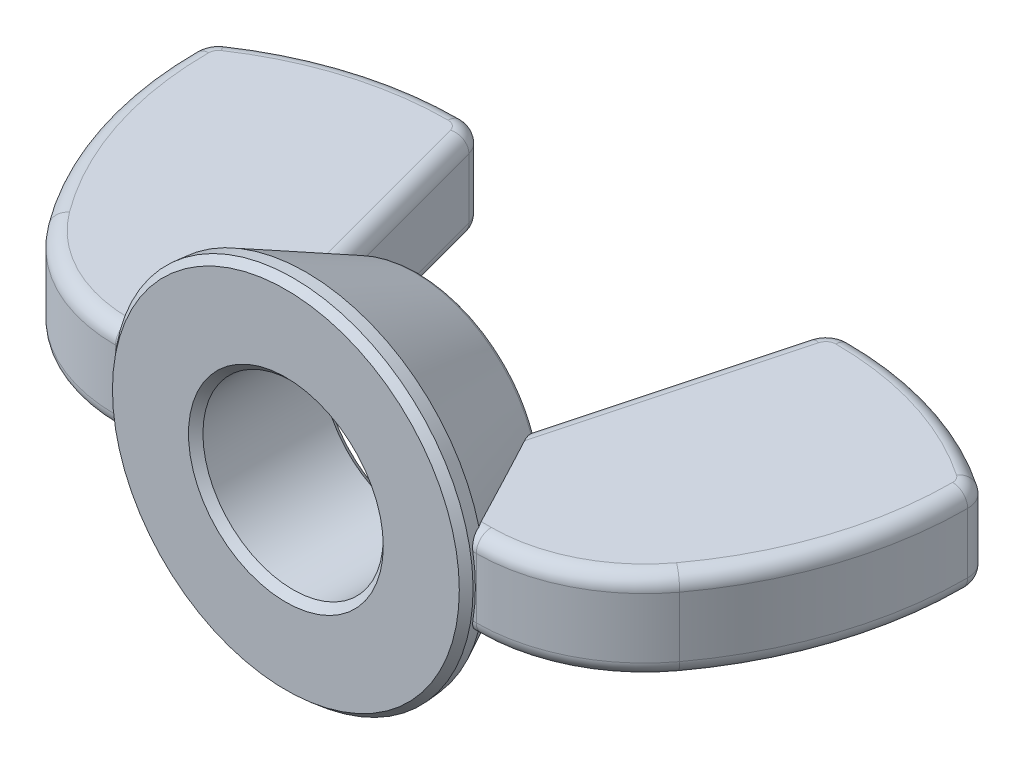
ISO-10303-21;
HEADER;
FILE_DESCRIPTION(('STEP AP214'),'2;1');
FILE_NAME('part.step','',(''),(''),'','','');
FILE_SCHEMA(('AUTOMOTIVE_DESIGN { 1 0 10303 214 1 1 1 1 }'));
ENDSEC;
DATA;
#1=APPLICATION_CONTEXT('core data for automotive mechanical design processes');
#2=APPLICATION_PROTOCOL_DEFINITION('international standard','automotive_design',2000,#1);
#3=PRODUCT_CONTEXT('',#1,'mechanical');
#4=PRODUCT('Part','Part','',(#3));
#5=PRODUCT_RELATED_PRODUCT_CATEGORY('part','',(#4));
#6=PRODUCT_DEFINITION_FORMATION('','',#4);
#7=PRODUCT_DEFINITION_CONTEXT('part definition',#1,'design');
#8=PRODUCT_DEFINITION('design','',#6,#7);
#9=PRODUCT_DEFINITION_SHAPE('','',#8);
#10=(LENGTH_UNIT() NAMED_UNIT(*) SI_UNIT(.MILLI.,.METRE.));
#11=(NAMED_UNIT(*) PLANE_ANGLE_UNIT() SI_UNIT($,.RADIAN.));
#12=(NAMED_UNIT(*) SI_UNIT($,.STERADIAN.) SOLID_ANGLE_UNIT());
#13=UNCERTAINTY_MEASURE_WITH_UNIT(LENGTH_MEASURE(1.E-05),#10,'distance_accuracy_value','');
#14=(GEOMETRIC_REPRESENTATION_CONTEXT(3) GLOBAL_UNCERTAINTY_ASSIGNED_CONTEXT((#13)) GLOBAL_UNIT_ASSIGNED_CONTEXT((#10,
#11,#12)) REPRESENTATION_CONTEXT('',''));
#15=CARTESIAN_POINT('',(0.,0.,0.));
#16=DIRECTION('',(0.,0.,1.));
#17=DIRECTION('',(1.,0.,0.));
#18=AXIS2_PLACEMENT_3D('',#15,#16,#17);
#19=CARTESIAN_POINT('',(-5.,1.25,-4.94319992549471));
#20=DIRECTION('',(0.,1.,0.));
#21=DIRECTION('',(0.,0.,1.));
#22=AXIS2_PLACEMENT_3D('',#19,#20,#21);
#23=PLANE('',#22);
#24=DIRECTION('',(-1.,0.,0.));
#25=VECTOR('',#24,1.);
#26=CARTESIAN_POINT('',(-5.,1.25,-0.694496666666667));
#27=LINE('',#26,#25);
#28=CARTESIAN_POINT('',(-4.71880912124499,1.25,-0.694496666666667));
#29=VERTEX_POINT('',#28);
#30=CARTESIAN_POINT('',(-5.,1.25,-0.694496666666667));
#31=VERTEX_POINT('',#30);
#32=EDGE_CURVE('E685',#29,#31,#27,.T.);
#33=ORIENTED_EDGE('',*,*,#32,.F.);
#34=CARTESIAN_POINT('',(-5.76055455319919,1.25,1.31986992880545));
#35=CARTESIAN_POINT('',(-5.56834193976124,1.25,0.946421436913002));
#36=CARTESIAN_POINT('',(-5.37583148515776,1.25,0.573125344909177));
#37=CARTESIAN_POINT('',(-4.98991895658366,1.25,-0.172871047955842));
#38=CARTESIAN_POINT('',(-4.79651715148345,1.25,-0.545571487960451));
#39=CARTESIAN_POINT('',(-4.40863752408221,1.25,-1.28987514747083));
#40=CARTESIAN_POINT('',(-4.21416117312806,1.25,-1.6614791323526));
#41=CARTESIAN_POINT('',(-3.92096107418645,1.25,-2.21816721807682));
#42=CARTESIAN_POINT('',(-3.82296670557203,1.25,-2.40363539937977));
#43=CARTESIAN_POINT('',(-3.62636397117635,1.25,-2.77425081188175));
#44=CARTESIAN_POINT('',(-3.52775559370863,1.25,-2.95939803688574));
#45=CARTESIAN_POINT('',(-3.32954575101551,1.25,-3.32968236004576));
#46=CARTESIAN_POINT('',(-3.22994258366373,1.25,-3.514818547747));
#47=CARTESIAN_POINT('',(-3.02972992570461,1.25,-3.88453088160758));
#48=CARTESIAN_POINT('',(-2.92912050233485,1.25,-4.06910706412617));
#49=CARTESIAN_POINT('',(-2.72662437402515,1.25,-4.43737905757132));
#50=CARTESIAN_POINT('',(-2.62473867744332,1.25,-4.62107542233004));
#51=CARTESIAN_POINT('',(-2.4190852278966,1.25,-4.98747394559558));
#52=CARTESIAN_POINT('',(-2.31531703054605,1.25,-5.17017585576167));
#53=CARTESIAN_POINT('',(-2.15751394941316,1.25,-5.44328974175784));
#54=CARTESIAN_POINT('',(-2.10448709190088,1.25,-5.53428391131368));
#55=CARTESIAN_POINT('',(-1.99759816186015,1.25,-5.71577654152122));
#56=CARTESIAN_POINT('',(-1.94373612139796,1.25,-5.80627502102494));
#57=CARTESIAN_POINT('',(-1.83500822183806,1.25,-5.98658163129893));
#58=CARTESIAN_POINT('',(-1.7801430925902,1.25,-6.07639020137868));
#59=CARTESIAN_POINT('',(-1.66908134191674,1.25,-6.25520092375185));
#60=CARTESIAN_POINT('',(-1.6128845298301,1.25,-6.34420295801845));
#61=CARTESIAN_POINT('',(-1.49859522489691,1.25,-6.52136286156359));
#62=CARTESIAN_POINT('',(-1.44049755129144,1.25,-6.60951739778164));
#63=CARTESIAN_POINT('',(-1.32200043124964,1.25,-6.7842300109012));
#64=CARTESIAN_POINT('',(-1.26160190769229,1.25,-6.87078870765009));
#65=CARTESIAN_POINT('',(-1.16849363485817,1.25,-6.99897078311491));
#66=CARTESIAN_POINT('',(-1.13699763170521,1.25,-7.04147493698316));
#67=CARTESIAN_POINT('',(-1.07302183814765,1.25,-7.1257289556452));
#68=CARTESIAN_POINT('',(-1.04054218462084,1.25,-7.16747892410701));
#69=CARTESIAN_POINT('',(-0.974345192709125,1.25,-7.25008525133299));
#70=CARTESIAN_POINT('',(-0.940626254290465,1.25,-7.2909403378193));
#71=CARTESIAN_POINT('',(-0.871677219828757,1.25,-7.37138514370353));
#72=CARTESIAN_POINT('',(-0.836446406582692,1.25,-7.41097424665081));
#73=CARTESIAN_POINT('',(-0.80031832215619,1.25,-7.44975356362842));
#74=B_SPLINE_CURVE_WITH_KNOTS('',3,(#34,#35,#36,#37,#38,#39,#40,#41,#42,#43,#44,#45,#46,#47,#48,
#49,#50,#51,#52,#53,#54,#55,#56,#57,#58,#59,#60,#61,#62,#63,#64,#65,#66,#67,#68,#69,#70,#71,#72,
#73),.UNSPECIFIED.,.F.,.F.,(4,2,2,2,2,2,2,2,2,2,2,2,2,2,2,2,2,2,2,4),(0.,1.26003478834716,
2.51971157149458,3.77795785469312,4.40725191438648,5.03655798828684,5.66724246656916,
6.29788508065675,6.9280574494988,7.55838056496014,7.87432984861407,8.19026703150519,
8.50598282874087,8.82174410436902,9.13845256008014,9.45503529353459,9.61372924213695,
9.77240120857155,9.93128577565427,10.0902465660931),.UNSPECIFIED.);
#75=CARTESIAN_POINT('',(-3.38032948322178,1.25,-3.23473510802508));
#76=VERTEX_POINT('',#75);
#77=EDGE_CURVE('E468',#29,#76,#74,.T.);
#78=ORIENTED_EDGE('',*,*,#77,.T.);
#79=DIRECTION('',(0.258819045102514,0.,0.96592582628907));
#80=VECTOR('',#79,1.);
#81=CARTESIAN_POINT('',(-3.47727983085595,1.25,-3.59655873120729));
#82=LINE('',#81,#80);
#83=CARTESIAN_POINT('',(-5.10397017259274,1.25,-9.6674497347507));
#84=VERTEX_POINT('',#83);
#85=EDGE_CURVE('E679',#84,#76,#82,.T.);
#86=ORIENTED_EDGE('',*,*,#85,.F.);
#87=CARTESIAN_POINT('',(-5.37228290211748,1.25,-9.59555555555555));
#88=DIRECTION('',(0.,-1.,0.));
#89=DIRECTION('',(0.,0.,1.));
#90=AXIS2_PLACEMENT_3D('',#87,#88,#89);
#91=CIRCLE('',#90,0.277777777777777);
#92=CARTESIAN_POINT('',(-5.37228290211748,1.25,-9.87333333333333));
#93=VERTEX_POINT('',#92);
#94=EDGE_CURVE('E676',#93,#84,#91,.T.);
#95=ORIENTED_EDGE('',*,*,#94,.F.);
#96=CARTESIAN_POINT('',(-5.37228290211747,1.25,-1.25626400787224));
#97=DIRECTION('',(0.,-1.,0.));
#98=DIRECTION('',(0.,0.,1.));
#99=AXIS2_PLACEMENT_3D('',#96,#97,#98);
#100=CIRCLE('',#99,8.61706932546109);
#101=CARTESIAN_POINT('',(-10.1908869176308,1.25,-8.40013824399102));
#102=VERTEX_POINT('',#101);
#103=EDGE_CURVE('E673',#102,#93,#100,.T.);
#104=ORIENTED_EDGE('',*,*,#103,.F.);
#105=CARTESIAN_POINT('',(-10.0355555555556,1.25,-8.16985002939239));
#106=DIRECTION('',(0.,-1.,0.));
#107=DIRECTION('',(0.,0.,1.));
#108=AXIS2_PLACEMENT_3D('',#105,#106,#107);
#109=CIRCLE('',#108,0.277777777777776);
#110=CARTESIAN_POINT('',(-10.3133333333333,1.25,-8.16985002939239));
#111=VERTEX_POINT('',#110);
#112=EDGE_CURVE('E670',#111,#102,#109,.T.);
#113=ORIENTED_EDGE('',*,*,#112,.F.);
#114=CARTESIAN_POINT('',(-0.642696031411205,1.25,-8.16985002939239));
#115=DIRECTION('',(0.,-1.,0.));
#116=DIRECTION('',(0.,0.,1.));
#117=AXIS2_PLACEMENT_3D('',#114,#115,#116);
#118=CIRCLE('',#117,9.67063730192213);
#119=CARTESIAN_POINT('',(-8.41444425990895,1.25,-2.41475182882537));
#120=VERTEX_POINT('',#119);
#121=EDGE_CURVE('E667',#120,#111,#118,.T.);
#122=ORIENTED_EDGE('',*,*,#121,.F.);
#123=CARTESIAN_POINT('',(-5.,1.25,-4.94319992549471));
#124=DIRECTION('',(0.,-1.,0.));
#125=DIRECTION('',(0.,0.,1.));
#126=AXIS2_PLACEMENT_3D('',#123,#124,#125);
#127=CIRCLE('',#126,4.24870325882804);
#128=EDGE_CURVE('E682',#31,#120,#127,.T.);
#129=ORIENTED_EDGE('',*,*,#128,.F.);
#130=EDGE_LOOP('',(#33,#78,#86,#95,#104,#113,#122,#129));
#131=FACE_BOUND('',#130,.T.);
#132=ADVANCED_FACE('F37',(#131),#23,.T.);
#133=CARTESIAN_POINT('',(-5.,-1.25,-4.94319992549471));
#134=DIRECTION('',(0.,1.,0.));
#135=DIRECTION('',(0.,0.,1.));
#136=AXIS2_PLACEMENT_3D('',#133,#134,#135);
#137=PLANE('',#136);
#138=CARTESIAN_POINT('',(-5.76055455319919,-1.25,1.31986992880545));
#139=CARTESIAN_POINT('',(-5.56834193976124,-1.25,0.946421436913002));
#140=CARTESIAN_POINT('',(-5.37583148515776,-1.25,0.573125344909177));
#141=CARTESIAN_POINT('',(-4.98991895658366,-1.25,-0.172871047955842));
#142=CARTESIAN_POINT('',(-4.79651715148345,-1.25,-0.545571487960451));
#143=CARTESIAN_POINT('',(-4.40863752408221,-1.25,-1.28987514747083));
#144=CARTESIAN_POINT('',(-4.21416117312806,-1.25,-1.6614791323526));
#145=CARTESIAN_POINT('',(-3.92096107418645,-1.25,-2.21816721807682));
#146=CARTESIAN_POINT('',(-3.82296670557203,-1.25,-2.40363539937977));
#147=CARTESIAN_POINT('',(-3.62636397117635,-1.25,-2.77425081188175));
#148=CARTESIAN_POINT('',(-3.52775559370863,-1.25,-2.95939803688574));
#149=CARTESIAN_POINT('',(-3.32954575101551,-1.25,-3.32968236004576));
#150=CARTESIAN_POINT('',(-3.22994258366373,-1.25,-3.514818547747));
#151=CARTESIAN_POINT('',(-3.02972992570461,-1.25,-3.88453088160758));
#152=CARTESIAN_POINT('',(-2.92912050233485,-1.25,-4.06910706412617));
#153=CARTESIAN_POINT('',(-2.72662437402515,-1.25,-4.43737905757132));
#154=CARTESIAN_POINT('',(-2.62473867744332,-1.25,-4.62107542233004));
#155=CARTESIAN_POINT('',(-2.4190852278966,-1.25,-4.98747394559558));
#156=CARTESIAN_POINT('',(-2.31531703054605,-1.25,-5.17017585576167));
#157=CARTESIAN_POINT('',(-2.15751394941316,-1.25,-5.44328974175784));
#158=CARTESIAN_POINT('',(-2.10448709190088,-1.25,-5.53428391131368));
#159=CARTESIAN_POINT('',(-1.99759816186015,-1.25,-5.71577654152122));
#160=CARTESIAN_POINT('',(-1.94373612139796,-1.25,-5.80627502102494));
#161=CARTESIAN_POINT('',(-1.83500822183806,-1.25,-5.98658163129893));
#162=CARTESIAN_POINT('',(-1.7801430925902,-1.25,-6.07639020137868));
#163=CARTESIAN_POINT('',(-1.66908134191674,-1.25,-6.25520092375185));
#164=CARTESIAN_POINT('',(-1.6128845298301,-1.25,-6.34420295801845));
#165=CARTESIAN_POINT('',(-1.49859522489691,-1.25,-6.52136286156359));
#166=CARTESIAN_POINT('',(-1.44049755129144,-1.25,-6.60951739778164));
#167=CARTESIAN_POINT('',(-1.32200043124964,-1.25,-6.7842300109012));
#168=CARTESIAN_POINT('',(-1.26160190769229,-1.25,-6.87078870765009));
#169=CARTESIAN_POINT('',(-1.16849363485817,-1.25,-6.99897078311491));
#170=CARTESIAN_POINT('',(-1.13699763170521,-1.25,-7.04147493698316));
#171=CARTESIAN_POINT('',(-1.07302183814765,-1.25,-7.1257289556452));
#172=CARTESIAN_POINT('',(-1.04054218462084,-1.25,-7.16747892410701));
#173=CARTESIAN_POINT('',(-0.974345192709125,-1.25,-7.25008525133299));
#174=CARTESIAN_POINT('',(-0.940626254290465,-1.25,-7.2909403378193));
#175=CARTESIAN_POINT('',(-0.871677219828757,-1.25,-7.37138514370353));
#176=CARTESIAN_POINT('',(-0.836446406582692,-1.25,-7.41097424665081));
#177=CARTESIAN_POINT('',(-0.80031832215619,-1.25,-7.44975356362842));
#178=B_SPLINE_CURVE_WITH_KNOTS('',3,(#138,#139,#140,#141,#142,#143,#144,#145,#146,#147,#148,
#149,#150,#151,#152,#153,#154,#155,#156,#157,#158,#159,#160,#161,#162,#163,#164,#165,#166,#167,
#168,#169,#170,#171,#172,#173,#174,#175,#176,#177),.UNSPECIFIED.,.F.,.F.,(4,2,2,2,2,2,2,2,2,2,2,
2,2,2,2,2,2,2,2,4),(0.,1.26003478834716,2.51971157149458,3.77795785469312,4.40725191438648,
5.03655798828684,5.66724246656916,6.29788508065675,6.9280574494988,7.55838056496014,
7.87432984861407,8.19026703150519,8.50598282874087,8.82174410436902,9.13845256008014,
9.45503529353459,9.61372924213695,9.77240120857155,9.93128577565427,10.0902465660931),.UNSPECIFIED.);
#179=CARTESIAN_POINT('',(-4.71880912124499,-1.25,-0.694496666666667));
#180=VERTEX_POINT('',#179);
#181=CARTESIAN_POINT('',(-3.38032948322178,-1.25,-3.23473510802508));
#182=VERTEX_POINT('',#181);
#183=EDGE_CURVE('E396',#180,#182,#178,.T.);
#184=ORIENTED_EDGE('',*,*,#183,.F.);
#185=DIRECTION('',(-1.,0.,0.));
#186=VECTOR('',#185,1.);
#187=CARTESIAN_POINT('',(-5.,-1.25,-0.694496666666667));
#188=LINE('',#187,#186);
#189=CARTESIAN_POINT('',(-5.,-1.25,-0.694496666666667));
#190=VERTEX_POINT('',#189);
#191=EDGE_CURVE('E606',#190,#180,#188,.F.);
#192=ORIENTED_EDGE('',*,*,#191,.F.);
#193=CARTESIAN_POINT('',(-5.,-1.25,-4.94319992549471));
#194=DIRECTION('',(0.,-1.,0.));
#195=DIRECTION('',(0.,0.,1.));
#196=AXIS2_PLACEMENT_3D('',#193,#194,#195);
#197=CIRCLE('',#196,4.24870325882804);
#198=CARTESIAN_POINT('',(-8.41444425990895,-1.25,-2.41475182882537));
#199=VERTEX_POINT('',#198);
#200=EDGE_CURVE('E603',#199,#190,#197,.F.);
#201=ORIENTED_EDGE('',*,*,#200,.F.);
#202=CARTESIAN_POINT('',(-0.642696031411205,-1.25,-8.16985002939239));
#203=DIRECTION('',(0.,-1.,0.));
#204=DIRECTION('',(0.,0.,1.));
#205=AXIS2_PLACEMENT_3D('',#202,#203,#204);
#206=CIRCLE('',#205,9.67063730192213);
#207=CARTESIAN_POINT('',(-10.3133333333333,-1.25,-8.16985002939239));
#208=VERTEX_POINT('',#207);
#209=EDGE_CURVE('E598',#208,#199,#206,.F.);
#210=ORIENTED_EDGE('',*,*,#209,.F.);
#211=CARTESIAN_POINT('',(-10.0355555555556,-1.25,-8.16985002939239));
#212=DIRECTION('',(0.,-1.,0.));
#213=DIRECTION('',(0.,0.,1.));
#214=AXIS2_PLACEMENT_3D('',#211,#212,#213);
#215=CIRCLE('',#214,0.277777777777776);
#216=CARTESIAN_POINT('',(-10.1908869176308,-1.25,-8.40013824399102));
#217=VERTEX_POINT('',#216);
#218=EDGE_CURVE('E596',#217,#208,#215,.F.);
#219=ORIENTED_EDGE('',*,*,#218,.F.);
#220=CARTESIAN_POINT('',(-5.37228290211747,-1.25,-1.25626400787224));
#221=DIRECTION('',(0.,-1.,0.));
#222=DIRECTION('',(0.,0.,1.));
#223=AXIS2_PLACEMENT_3D('',#220,#221,#222);
#224=CIRCLE('',#223,8.61706932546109);
#225=CARTESIAN_POINT('',(-5.37228290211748,-1.25,-9.87333333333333));
#226=VERTEX_POINT('',#225);
#227=EDGE_CURVE('E577',#226,#217,#224,.F.);
#228=ORIENTED_EDGE('',*,*,#227,.F.);
#229=CARTESIAN_POINT('',(-5.37228290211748,-1.25,-9.59555555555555));
#230=DIRECTION('',(0.,-1.,0.));
#231=DIRECTION('',(0.,0.,1.));
#232=AXIS2_PLACEMENT_3D('',#229,#230,#231);
#233=CIRCLE('',#232,0.277777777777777);
#234=CARTESIAN_POINT('',(-5.10397017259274,-1.25,-9.6674497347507));
#235=VERTEX_POINT('',#234);
#236=EDGE_CURVE('E589',#235,#226,#233,.F.);
#237=ORIENTED_EDGE('',*,*,#236,.F.);
#238=DIRECTION('',(0.258819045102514,0.,0.96592582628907));
#239=VECTOR('',#238,1.);
#240=CARTESIAN_POINT('',(-3.91594303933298,-1.25,-5.23367211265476));
#241=LINE('',#240,#239);
#242=EDGE_CURVE('E591',#182,#235,#241,.F.);
#243=ORIENTED_EDGE('',*,*,#242,.F.);
#244=EDGE_LOOP('',(#184,#192,#201,#210,#219,#228,#237,#243));
#245=FACE_BOUND('',#244,.T.);
#246=ADVANCED_FACE('F484',(#245),#137,.F.);
#247=CARTESIAN_POINT('',(-3.07481073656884,1.25,-0.27783));
#248=DIRECTION('',(0.,0.,-1.));
#249=DIRECTION('',(1.,0.,0.));
#250=AXIS2_PLACEMENT_3D('',#247,#248,#249);
#251=PLANE('',#250);
#252=DIRECTION('',(-1.,0.,0.));
#253=VECTOR('',#252,1.);
#254=CARTESIAN_POINT('',(-3.07481073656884,-0.833333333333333,-0.27783));
#255=LINE('',#254,#253);
#256=CARTESIAN_POINT('',(-4.90541299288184,-0.833333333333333,-0.27783));
#257=VERTEX_POINT('',#256);
#258=CARTESIAN_POINT('',(-5.,-0.833333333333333,-0.27783));
#259=VERTEX_POINT('',#258);
#260=EDGE_CURVE('E687',#257,#259,#255,.T.);
#261=ORIENTED_EDGE('',*,*,#260,.F.);
#262=CARTESIAN_POINT('',(0.,0.,-0.277830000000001));
#263=DIRECTION('',(0.,0.,-1.));
#264=DIRECTION('',(-1.,0.,0.));
#265=AXIS2_PLACEMENT_3D('',#262,#263,#264);
#266=CIRCLE('',#265,4.97569302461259);
#267=CARTESIAN_POINT('',(-4.90541299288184,0.833333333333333,-0.27783));
#268=VERTEX_POINT('',#267);
#269=EDGE_CURVE('E534',#257,#268,#266,.T.);
#270=ORIENTED_EDGE('',*,*,#269,.T.);
#271=DIRECTION('',(-1.,0.,0.));
#272=VECTOR('',#271,1.);
#273=CARTESIAN_POINT('',(-3.07481073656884,0.833333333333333,-0.27783));
#274=LINE('',#273,#272);
#275=CARTESIAN_POINT('',(-5.,0.833333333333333,-0.27783));
#276=VERTEX_POINT('',#275);
#277=EDGE_CURVE('E689',#276,#268,#274,.F.);
#278=ORIENTED_EDGE('',*,*,#277,.F.);
#279=DIRECTION('',(0.,-1.,0.));
#280=VECTOR('',#279,1.);
#281=CARTESIAN_POINT('',(-5.,1.25,-0.27783));
#282=LINE('',#281,#280);
#283=EDGE_CURVE('E664',#276,#259,#282,.T.);
#284=ORIENTED_EDGE('',*,*,#283,.T.);
#285=EDGE_LOOP('',(#261,#270,#278,#284));
#286=FACE_BOUND('',#285,.T.);
#287=ADVANCED_FACE('F492',(#286),#251,.F.);
#288=CARTESIAN_POINT('',(-5.,1.25,-4.94319992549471));
#289=DIRECTION('',(0.,-1.,0.));
#290=DIRECTION('',(0.,0.,-1.));
#291=AXIS2_PLACEMENT_3D('',#288,#289,#290);
#292=CYLINDRICAL_SURFACE('',#291,4.66536992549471);
#293=DIRECTION('',(0.,-1.,0.));
#294=VECTOR('',#293,1.);
#295=CARTESIAN_POINT('',(-8.74929586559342,1.25,-2.16678910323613));
#296=LINE('',#295,#294);
#297=CARTESIAN_POINT('',(-8.74929586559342,0.833333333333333,-2.16678910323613));
#298=VERTEX_POINT('',#297);
#299=CARTESIAN_POINT('',(-8.74929586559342,-0.833333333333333,-2.16678910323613));
#300=VERTEX_POINT('',#299);
#301=EDGE_CURVE('E661',#298,#300,#296,.T.);
#302=ORIENTED_EDGE('',*,*,#301,.T.);
#303=CARTESIAN_POINT('',(-5.,-0.833333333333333,-4.94319992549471));
#304=DIRECTION('',(0.,-1.,0.));
#305=DIRECTION('',(0.,0.,1.));
#306=AXIS2_PLACEMENT_3D('',#303,#304,#305);
#307=CIRCLE('',#306,4.66536992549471);
#308=EDGE_CURVE('E692',#259,#300,#307,.T.);
#309=ORIENTED_EDGE('',*,*,#308,.F.);
#310=ORIENTED_EDGE('',*,*,#283,.F.);
#311=CARTESIAN_POINT('',(-5.,0.833333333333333,-4.94319992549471));
#312=DIRECTION('',(0.,-1.,0.));
#313=DIRECTION('',(0.,0.,1.));
#314=AXIS2_PLACEMENT_3D('',#311,#312,#313);
#315=CIRCLE('',#314,4.66536992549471);
#316=EDGE_CURVE('E643',#298,#276,#315,.F.);
#317=ORIENTED_EDGE('',*,*,#316,.F.);
#318=EDGE_LOOP('',(#302,#309,#310,#317));
#319=FACE_BOUND('',#318,.T.);
#320=ADVANCED_FACE('F514',(#319),#292,.T.);
#321=CARTESIAN_POINT('',(-0.642696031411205,1.25,-8.16985002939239));
#322=DIRECTION('',(0.,-1.,0.));
#323=DIRECTION('',(0.,0.,-1.));
#324=AXIS2_PLACEMENT_3D('',#321,#322,#323);
#325=CYLINDRICAL_SURFACE('',#324,10.0873039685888);
#326=DIRECTION('',(0.,-1.,0.));
#327=VECTOR('',#326,1.);
#328=CARTESIAN_POINT('',(-10.73,1.25,-8.16985002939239));
#329=LINE('',#328,#327);
#330=CARTESIAN_POINT('',(-10.73,0.833333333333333,-8.16985002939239));
#331=VERTEX_POINT('',#330);
#332=CARTESIAN_POINT('',(-10.73,-0.833333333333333,-8.16985002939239));
#333=VERTEX_POINT('',#332);
#334=EDGE_CURVE('E658',#331,#333,#329,.T.);
#335=ORIENTED_EDGE('',*,*,#334,.T.);
#336=CARTESIAN_POINT('',(-0.642696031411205,-0.833333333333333,-8.16985002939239));
#337=DIRECTION('',(0.,-1.,0.));
#338=DIRECTION('',(0.,0.,1.));
#339=AXIS2_PLACEMENT_3D('',#336,#337,#338);
#340=CIRCLE('',#339,10.0873039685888);
#341=EDGE_CURVE('E608',#300,#333,#340,.T.);
#342=ORIENTED_EDGE('',*,*,#341,.F.);
#343=ORIENTED_EDGE('',*,*,#301,.F.);
#344=CARTESIAN_POINT('',(-0.642696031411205,0.833333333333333,-8.16985002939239));
#345=DIRECTION('',(0.,-1.,0.));
#346=DIRECTION('',(0.,0.,1.));
#347=AXIS2_PLACEMENT_3D('',#344,#345,#346);
#348=CIRCLE('',#347,10.0873039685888);
#349=EDGE_CURVE('E611',#331,#298,#348,.F.);
#350=ORIENTED_EDGE('',*,*,#349,.F.);
#351=EDGE_LOOP('',(#335,#342,#343,#350));
#352=FACE_BOUND('',#351,.T.);
#353=ADVANCED_FACE('F510',(#352),#325,.T.);
#354=CARTESIAN_POINT('',(-10.0355555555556,1.25,-8.16985002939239));
#355=DIRECTION('',(0.,-1.,0.));
#356=DIRECTION('',(0.,0.,-1.));
#357=AXIS2_PLACEMENT_3D('',#354,#355,#356);
#358=CYLINDRICAL_SURFACE('',#357,0.694444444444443);
#359=DIRECTION('',(0.,-1.,0.));
#360=VECTOR('',#359,1.);
#361=CARTESIAN_POINT('',(-10.4238839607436,1.25,-8.74557056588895));
#362=LINE('',#361,#360);
#363=CARTESIAN_POINT('',(-10.4238839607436,0.833333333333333,-8.74557056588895));
#364=VERTEX_POINT('',#363);
#365=CARTESIAN_POINT('',(-10.4238839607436,-0.833333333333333,-8.74557056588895));
#366=VERTEX_POINT('',#365);
#367=EDGE_CURVE('E653',#364,#366,#362,.T.);
#368=ORIENTED_EDGE('',*,*,#367,.T.);
#369=CARTESIAN_POINT('',(-10.0355555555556,-0.833333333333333,-8.16985002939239));
#370=DIRECTION('',(0.,-1.,0.));
#371=DIRECTION('',(0.,0.,1.));
#372=AXIS2_PLACEMENT_3D('',#369,#370,#371);
#373=CIRCLE('',#372,0.694444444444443);
#374=EDGE_CURVE('E704',#333,#366,#373,.T.);
#375=ORIENTED_EDGE('',*,*,#374,.F.);
#376=ORIENTED_EDGE('',*,*,#334,.F.);
#377=CARTESIAN_POINT('',(-10.0355555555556,0.833333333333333,-8.16985002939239));
#378=DIRECTION('',(0.,-1.,0.));
#379=DIRECTION('',(0.,0.,1.));
#380=AXIS2_PLACEMENT_3D('',#377,#378,#379);
#381=CIRCLE('',#380,0.694444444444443);
#382=EDGE_CURVE('E707',#364,#331,#381,.F.);
#383=ORIENTED_EDGE('',*,*,#382,.F.);
#384=EDGE_LOOP('',(#368,#375,#376,#383));
#385=FACE_BOUND('',#384,.T.);
#386=ADVANCED_FACE('F506',(#385),#358,.T.);
#387=CARTESIAN_POINT('',(-5.37228290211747,1.25,-1.25626400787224));
#388=DIRECTION('',(0.,-1.,0.));
#389=DIRECTION('',(0.,0.,-1.));
#390=AXIS2_PLACEMENT_3D('',#387,#388,#389);
#391=CYLINDRICAL_SURFACE('',#390,9.03373599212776);
#392=DIRECTION('',(0.,-1.,0.));
#393=VECTOR('',#392,1.);
#394=CARTESIAN_POINT('',(-5.37228290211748,1.25,-10.29));
#395=LINE('',#394,#393);
#396=CARTESIAN_POINT('',(-5.37228290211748,0.833333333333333,-10.29));
#397=VERTEX_POINT('',#396);
#398=CARTESIAN_POINT('',(-5.37228290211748,-0.833333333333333,-10.29));
#399=VERTEX_POINT('',#398);
#400=EDGE_CURVE('E651',#397,#399,#395,.T.);
#401=ORIENTED_EDGE('',*,*,#400,.T.);
#402=CARTESIAN_POINT('',(-5.37228290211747,-0.833333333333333,-1.25626400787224));
#403=DIRECTION('',(0.,-1.,0.));
#404=DIRECTION('',(0.,0.,1.));
#405=AXIS2_PLACEMENT_3D('',#402,#403,#404);
#406=CIRCLE('',#405,9.03373599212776);
#407=EDGE_CURVE('E580',#366,#399,#406,.T.);
#408=ORIENTED_EDGE('',*,*,#407,.F.);
#409=ORIENTED_EDGE('',*,*,#367,.F.);
#410=CARTESIAN_POINT('',(-5.37228290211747,0.833333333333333,-1.25626400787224));
#411=DIRECTION('',(0.,-1.,0.));
#412=DIRECTION('',(0.,0.,1.));
#413=AXIS2_PLACEMENT_3D('',#410,#411,#412);
#414=CIRCLE('',#413,9.03373599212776);
#415=EDGE_CURVE('E701',#397,#364,#414,.F.);
#416=ORIENTED_EDGE('',*,*,#415,.F.);
#417=EDGE_LOOP('',(#401,#408,#409,#416));
#418=FACE_BOUND('',#417,.T.);
#419=ADVANCED_FACE('F502',(#418),#391,.T.);
#420=CARTESIAN_POINT('',(-5.37228290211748,1.25,-9.59555555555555));
#421=DIRECTION('',(0.,-1.,0.));
#422=DIRECTION('',(0.,0.,-1.));
#423=AXIS2_PLACEMENT_3D('',#420,#421,#422);
#424=CYLINDRICAL_SURFACE('',#423,0.694444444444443);
#425=DIRECTION('',(0.,-1.,0.));
#426=VECTOR('',#425,1.);
#427=CARTESIAN_POINT('',(-4.70150107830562,1.25,-9.77529100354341));
#428=LINE('',#427,#426);
#429=CARTESIAN_POINT('',(-4.70150107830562,0.833333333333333,-9.77529100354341));
#430=VERTEX_POINT('',#429);
#431=CARTESIAN_POINT('',(-4.70150107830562,-0.833333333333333,-9.77529100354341));
#432=VERTEX_POINT('',#431);
#433=EDGE_CURVE('E641',#430,#432,#428,.T.);
#434=ORIENTED_EDGE('',*,*,#433,.T.);
#435=CARTESIAN_POINT('',(-5.37228290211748,-0.833333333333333,-9.59555555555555));
#436=DIRECTION('',(0.,-1.,0.));
#437=DIRECTION('',(0.,0.,1.));
#438=AXIS2_PLACEMENT_3D('',#435,#436,#437);
#439=CIRCLE('',#438,0.694444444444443);
#440=EDGE_CURVE('E645',#399,#432,#439,.T.);
#441=ORIENTED_EDGE('',*,*,#440,.F.);
#442=ORIENTED_EDGE('',*,*,#400,.F.);
#443=CARTESIAN_POINT('',(-5.37228290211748,0.833333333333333,-9.59555555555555));
#444=DIRECTION('',(0.,-1.,0.));
#445=DIRECTION('',(0.,0.,1.));
#446=AXIS2_PLACEMENT_3D('',#443,#444,#445);
#447=CIRCLE('',#446,0.694444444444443);
#448=EDGE_CURVE('E647',#430,#397,#447,.F.);
#449=ORIENTED_EDGE('',*,*,#448,.F.);
#450=EDGE_LOOP('',(#434,#441,#442,#449));
#451=FACE_BOUND('',#450,.T.);
#452=ADVANCED_FACE('F498',(#451),#424,.T.);
#453=CARTESIAN_POINT('',(-3.07481073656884,1.25,-3.7044));
#454=DIRECTION('',(-0.96592582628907,0.,0.258819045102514));
#455=DIRECTION('',(-0.258819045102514,0.,-0.96592582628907));
#456=AXIS2_PLACEMENT_3D('',#453,#454,#455);
#457=PLANE('',#456);
#458=DIRECTION('',(0.,-1.,0.));
#459=VECTOR('',#458,1.);
#460=CARTESIAN_POINT('',(-3.07481073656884,1.25,-3.7044));
#461=LINE('',#460,#459);
#462=CARTESIAN_POINT('',(-3.07481073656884,0.833333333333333,-3.7044));
#463=VERTEX_POINT('',#462);
#464=CARTESIAN_POINT('',(-3.07481073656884,-0.833333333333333,-3.7044));
#465=VERTEX_POINT('',#464);
#466=EDGE_CURVE('E627',#463,#465,#461,.T.);
#467=ORIENTED_EDGE('',*,*,#466,.T.);
#468=DIRECTION('',(0.258819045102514,0.,0.96592582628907));
#469=VECTOR('',#468,1.);
#470=CARTESIAN_POINT('',(-3.07481073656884,-0.833333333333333,-3.7044));
#471=LINE('',#470,#469);
#472=EDGE_CURVE('E636',#432,#465,#471,.T.);
#473=ORIENTED_EDGE('',*,*,#472,.F.);
#474=ORIENTED_EDGE('',*,*,#433,.F.);
#475=DIRECTION('',(0.258819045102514,0.,0.96592582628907));
#476=VECTOR('',#475,1.);
#477=CARTESIAN_POINT('',(-4.70150107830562,0.833333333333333,-9.77529100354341));
#478=LINE('',#477,#476);
#479=EDGE_CURVE('E642',#463,#430,#478,.F.);
#480=ORIENTED_EDGE('',*,*,#479,.F.);
#481=EDGE_LOOP('',(#467,#473,#474,#480));
#482=FACE_BOUND('',#481,.T.);
#483=ADVANCED_FACE('F494',(#482),#457,.F.);
#484=CARTESIAN_POINT('',(-3.91594303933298,0.833333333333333,-5.23367211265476));
#485=DIRECTION('',(-0.258819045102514,0.,-0.96592582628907));
#486=DIRECTION('',(0.96592582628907,0.,-0.258819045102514));
#487=AXIS2_PLACEMENT_3D('',#484,#485,#486);
#488=CYLINDRICAL_SURFACE('',#487,0.416666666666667);
#489=CARTESIAN_POINT('',(-3.50617581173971,0.833333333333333,-3.7044));
#490=DIRECTION('',(0.,0.,-1.));
#491=DIRECTION('',(-1.,0.,0.));
#492=AXIS2_PLACEMENT_3D('',#489,#490,#491);
#493=ELLIPSE('',#492,0.431365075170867,0.416666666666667);
#494=CARTESIAN_POINT('',(-3.08118964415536,0.904724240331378,-3.7044));
#495=VERTEX_POINT('',#494);
#496=EDGE_CURVE('E540',#463,#495,#493,.F.);
#497=ORIENTED_EDGE('',*,*,#496,.F.);
#498=ORIENTED_EDGE('',*,*,#479,.T.);
#499=CARTESIAN_POINT('',(-5.10397017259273,0.833333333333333,-9.6674497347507));
#500=DIRECTION('',(0.258819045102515,0.,0.96592582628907));
#501=DIRECTION('',(0.96592582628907,0.,-0.258819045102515));
#502=AXIS2_PLACEMENT_3D('',#499,#500,#501);
#503=CIRCLE('',#502,0.416666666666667);
#504=EDGE_CURVE('E625',#430,#84,#503,.T.);
#505=ORIENTED_EDGE('',*,*,#504,.T.);
#506=ORIENTED_EDGE('',*,*,#85,.T.);
#507=CARTESIAN_POINT('',(-3.70737712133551,0.833133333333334,-2.84541731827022));
#508=CARTESIAN_POINT('',(-3.70613649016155,0.849573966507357,-2.84066472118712));
#509=CARTESIAN_POINT('',(-3.70413923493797,0.866304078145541,-2.83702893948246));
#510=CARTESIAN_POINT('',(-3.69864548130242,0.899859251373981,-2.83216625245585));
#511=CARTESIAN_POINT('',(-3.69514942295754,0.916684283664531,-2.83093864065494));
#512=CARTESIAN_POINT('',(-3.68665827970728,0.950006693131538,-2.83106473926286));
#513=CARTESIAN_POINT('',(-3.68165861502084,0.966502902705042,-2.83242640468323));
#514=CARTESIAN_POINT('',(-3.67033459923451,0.998582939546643,-2.83770780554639));
#515=CARTESIAN_POINT('',(-3.6640115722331,1.01416765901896,-2.84162499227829));
#516=CARTESIAN_POINT('',(-3.65048562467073,1.04359837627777,-2.85166341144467));
#517=CARTESIAN_POINT('',(-3.64331329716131,1.05748152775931,-2.8577179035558));
#518=CARTESIAN_POINT('',(-3.62820848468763,1.0837854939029,-2.87175500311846));
#519=CARTESIAN_POINT('',(-3.62027526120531,1.09620486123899,-2.8797394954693));
#520=CARTESIAN_POINT('',(-3.60080193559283,1.12385903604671,-2.9006351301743));
#521=CARTESIAN_POINT('',(-3.58903092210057,1.13838641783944,-2.91426817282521));
#522=CARTESIAN_POINT('',(-3.5650409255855,1.16446268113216,-2.94378875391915));
#523=CARTESIAN_POINT('',(-3.55282121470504,1.17600645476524,-2.9596800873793));
#524=CARTESIAN_POINT('',(-3.52348916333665,1.200301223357,-2.99963853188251));
#525=CARTESIAN_POINT('',(-3.50633854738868,1.21174839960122,-3.02446687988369));
#526=CARTESIAN_POINT('',(-3.47248359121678,1.22994958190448,-3.07605474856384));
#527=CARTESIAN_POINT('',(-3.45578016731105,1.23669456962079,-3.10281787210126));
#528=CARTESIAN_POINT('',(-3.41613142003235,1.24814455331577,-3.16924686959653));
#529=CARTESIAN_POINT('',(-3.39358787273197,1.25072778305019,-3.2095157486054));
#530=CARTESIAN_POINT('',(-3.3505589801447,1.24892711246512,-3.29098330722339));
#531=CARTESIAN_POINT('',(-3.33007709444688,1.24453170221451,-3.33218341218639));
#532=CARTESIAN_POINT('',(-3.29562899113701,1.2311857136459,-3.40563727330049));
#533=CARTESIAN_POINT('',(-3.28121057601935,1.22342297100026,-3.43790278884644));
#534=CARTESIAN_POINT('',(-3.25401895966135,1.20430407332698,-3.50181780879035));
#535=CARTESIAN_POINT('',(-3.24123650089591,1.19296952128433,-3.53346983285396));
#536=CARTESIAN_POINT('',(-3.22928584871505,1.17990191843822,-3.56472083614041));
#537=B_SPLINE_CURVE_WITH_KNOTS('',3,(#507,#508,#509,#510,#511,#512,#513,#514,#515,#516,#517,
#518,#519,#520,#521,#522,#523,#524,#525,#526,#527,#528,#529,#530,#531,#532,#533,#534,#535,#536),
.UNSPECIFIED.,.F.,.F.,(4,2,2,2,2,2,2,2,2,2,2,2,2,2,4),(0.,0.0514585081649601,0.102901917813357,
0.154503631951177,0.20605396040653,0.256119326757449,0.306233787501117,0.375269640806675,
0.444422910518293,0.54071234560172,0.63718595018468,0.775111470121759,0.913264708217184,
1.02160152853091,1.12929529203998),.UNSPECIFIED.);
#538=CARTESIAN_POINT('',(-3.2293623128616,1.17998572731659,-3.56452083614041));
#539=VERTEX_POINT('',#538);
#540=EDGE_CURVE('E475',#76,#539,#537,.T.);
#541=ORIENTED_EDGE('',*,*,#540,.T.);
#542=CARTESIAN_POINT('',(-3.07461073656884,0.841905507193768,-3.70331285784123));
#543=CARTESIAN_POINT('',(-3.07520168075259,0.863304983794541,-3.70386732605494));
#544=CARTESIAN_POINT('',(-3.07752332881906,0.884668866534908,-3.70441187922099));
#545=CARTESIAN_POINT('',(-3.08525831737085,0.926997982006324,-3.70438716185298));
#546=CARTESIAN_POINT('',(-3.0906954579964,0.947958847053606,-3.70380923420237));
#547=CARTESIAN_POINT('',(-3.10314744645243,0.985428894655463,-3.70068459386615));
#548=CARTESIAN_POINT('',(-3.10975248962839,1.00210087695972,-3.69847939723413));
#549=CARTESIAN_POINT('',(-3.124453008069,1.03425020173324,-3.69182836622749));
#550=CARTESIAN_POINT('',(-3.13254222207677,1.04973218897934,-3.68739181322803));
#551=CARTESIAN_POINT('',(-3.1481140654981,1.07642934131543,-3.67677395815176));
#552=CARTESIAN_POINT('',(-3.15544576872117,1.08791203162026,-3.67104758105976));
#553=CARTESIAN_POINT('',(-3.17028426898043,1.10949527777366,-3.65753251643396));
#554=CARTESIAN_POINT('',(-3.17779116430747,1.11959503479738,-3.64974264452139));
#555=CARTESIAN_POINT('',(-3.19244945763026,1.13820924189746,-3.63208087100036));
#556=CARTESIAN_POINT('',(-3.19959911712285,1.14671640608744,-3.6221998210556));
#557=CARTESIAN_POINT('',(-3.21290435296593,1.1619742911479,-3.60061250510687));
#558=CARTESIAN_POINT('',(-3.21906196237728,1.16872862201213,-3.58891007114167));
#559=CARTESIAN_POINT('',(-3.22620528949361,1.17653411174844,-3.5725111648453));
#560=CARTESIAN_POINT('',(-3.22786522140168,1.17834523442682,-3.56844901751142));
#561=CARTESIAN_POINT('',(-3.22943870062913,1.18006942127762,-3.5643208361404));
#562=B_SPLINE_CURVE_WITH_KNOTS('',3,(#542,#543,#544,#545,#546,#547,#548,#549,#550,#551,#552,
#553,#554,#555,#556,#557,#558,#559,#560,#561),.UNSPECIFIED.,.F.,.F.,(4,2,2,2,2,2,2,2,2,4),(0.,
0.0642129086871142,0.128923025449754,0.182928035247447,0.236710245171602,0.280857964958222,
0.325031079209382,0.369401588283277,0.413679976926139,0.427912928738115),.UNSPECIFIED.);
#563=EDGE_CURVE('E303',#495,#539,#562,.T.);
#564=ORIENTED_EDGE('',*,*,#563,.F.);
#565=EDGE_LOOP('',(#497,#498,#505,#506,#541,#564));
#566=FACE_BOUND('',#565,.T.);
#567=ADVANCED_FACE('F497',(#566),#488,.T.);
#568=CARTESIAN_POINT('',(-5.37228290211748,0.833333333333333,-9.59555555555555));
#569=DIRECTION('',(0.,1.,0.));
#570=DIRECTION('',(0.,0.,1.));
#571=AXIS2_PLACEMENT_3D('',#568,#569,#570);
#572=DEGENERATE_TOROIDAL_SURFACE('',#571,0.277777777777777,0.416666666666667,.T.);
#573=ORIENTED_EDGE('',*,*,#504,.F.);
#574=ORIENTED_EDGE('',*,*,#448,.T.);
#575=CARTESIAN_POINT('',(-5.37228290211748,0.833333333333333,-9.87333333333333));
#576=DIRECTION('',(1.,0.,0.));
#577=DIRECTION('',(0.,0.,-1.));
#578=AXIS2_PLACEMENT_3D('',#575,#576,#577);
#579=CIRCLE('',#578,0.416666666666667);
#580=EDGE_CURVE('E623',#397,#93,#579,.T.);
#581=ORIENTED_EDGE('',*,*,#580,.T.);
#582=ORIENTED_EDGE('',*,*,#94,.T.);
#583=EDGE_LOOP('',(#573,#574,#581,#582));
#584=FACE_BOUND('',#583,.T.);
#585=ADVANCED_FACE('F545',(#584),#572,.T.);
#586=CARTESIAN_POINT('',(-5.37228290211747,0.833333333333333,-1.25626400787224));
#587=DIRECTION('',(0.,1.,0.));
#588=DIRECTION('',(0.,0.,1.));
#589=AXIS2_PLACEMENT_3D('',#586,#587,#588);
#590=TOROIDAL_SURFACE('',#589,8.61706932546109,0.416666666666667);
#591=ORIENTED_EDGE('',*,*,#580,.F.);
#592=ORIENTED_EDGE('',*,*,#415,.T.);
#593=CARTESIAN_POINT('',(-10.1908869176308,0.833333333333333,-8.40013824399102));
#594=DIRECTION('',(0.829037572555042,0.,-0.559192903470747));
#595=DIRECTION('',(-0.559192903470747,0.,-0.829037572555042));
#596=AXIS2_PLACEMENT_3D('',#593,#594,#595);
#597=CIRCLE('',#596,0.416666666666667);
#598=EDGE_CURVE('E621',#364,#102,#597,.T.);
#599=ORIENTED_EDGE('',*,*,#598,.T.);
#600=ORIENTED_EDGE('',*,*,#103,.T.);
#601=EDGE_LOOP('',(#591,#592,#599,#600));
#602=FACE_BOUND('',#601,.T.);
#603=ADVANCED_FACE('F723',(#602),#590,.T.);
#604=CARTESIAN_POINT('',(-10.0355555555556,0.833333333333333,-8.16985002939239));
#605=DIRECTION('',(0.,1.,0.));
#606=DIRECTION('',(0.,0.,1.));
#607=AXIS2_PLACEMENT_3D('',#604,#605,#606);
#608=DEGENERATE_TOROIDAL_SURFACE('',#607,0.277777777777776,0.416666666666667,.T.);
#609=ORIENTED_EDGE('',*,*,#598,.F.);
#610=ORIENTED_EDGE('',*,*,#382,.T.);
#611=CARTESIAN_POINT('',(-10.3133333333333,0.833333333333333,-8.16985002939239));
#612=DIRECTION('',(0.,0.,-1.));
#613=DIRECTION('',(-1.,0.,0.));
#614=AXIS2_PLACEMENT_3D('',#611,#612,#613);
#615=CIRCLE('',#614,0.416666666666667);
#616=EDGE_CURVE('E619',#331,#111,#615,.T.);
#617=ORIENTED_EDGE('',*,*,#616,.T.);
#618=ORIENTED_EDGE('',*,*,#112,.T.);
#619=EDGE_LOOP('',(#609,#610,#617,#618));
#620=FACE_BOUND('',#619,.T.);
#621=ADVANCED_FACE('F1028',(#620),#608,.T.);
#622=CARTESIAN_POINT('',(-0.642696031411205,0.833333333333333,-8.16985002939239));
#623=DIRECTION('',(0.,1.,0.));
#624=DIRECTION('',(0.,0.,1.));
#625=AXIS2_PLACEMENT_3D('',#622,#623,#624);
#626=TOROIDAL_SURFACE('',#625,9.67063730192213,0.416666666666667);
#627=ORIENTED_EDGE('',*,*,#616,.F.);
#628=ORIENTED_EDGE('',*,*,#349,.T.);
#629=CARTESIAN_POINT('',(-8.41444425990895,0.833333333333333,-2.41475182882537));
#630=DIRECTION('',(-0.595110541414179,0.,-0.803643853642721));
#631=DIRECTION('',(-0.803643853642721,0.,0.595110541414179));
#632=AXIS2_PLACEMENT_3D('',#629,#630,#631);
#633=CIRCLE('',#632,0.416666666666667);
#634=EDGE_CURVE('E617',#298,#120,#633,.T.);
#635=ORIENTED_EDGE('',*,*,#634,.T.);
#636=ORIENTED_EDGE('',*,*,#121,.T.);
#637=EDGE_LOOP('',(#627,#628,#635,#636));
#638=FACE_BOUND('',#637,.T.);
#639=ADVANCED_FACE('F1033',(#638),#626,.T.);
#640=CARTESIAN_POINT('',(-5.,0.833333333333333,-4.94319992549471));
#641=DIRECTION('',(0.,1.,0.));
#642=DIRECTION('',(0.,0.,1.));
#643=AXIS2_PLACEMENT_3D('',#640,#641,#642);
#644=TOROIDAL_SURFACE('',#643,4.24870325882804,0.416666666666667);
#645=ORIENTED_EDGE('',*,*,#634,.F.);
#646=ORIENTED_EDGE('',*,*,#316,.T.);
#647=CARTESIAN_POINT('',(-5.,0.833333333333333,-0.694496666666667));
#648=DIRECTION('',(-1.,0.,0.));
#649=DIRECTION('',(0.,0.,1.));
#650=AXIS2_PLACEMENT_3D('',#647,#648,#649);
#651=CIRCLE('',#650,0.416666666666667);
#652=EDGE_CURVE('E614',#276,#31,#651,.T.);
#653=ORIENTED_EDGE('',*,*,#652,.T.);
#654=ORIENTED_EDGE('',*,*,#128,.T.);
#655=EDGE_LOOP('',(#645,#646,#653,#654));
#656=FACE_BOUND('',#655,.T.);
#657=ADVANCED_FACE('F524',(#656),#644,.T.);
#658=CARTESIAN_POINT('',(-5.,0.833333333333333,-0.694496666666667));
#659=DIRECTION('',(1.,0.,0.));
#660=DIRECTION('',(0.,0.,1.));
#661=AXIS2_PLACEMENT_3D('',#658,#659,#660);
#662=CYLINDRICAL_SURFACE('',#661,0.416666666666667);
#663=CARTESIAN_POINT('',(-4.79711768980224,1.22625951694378,-0.55586));
#664=CARTESIAN_POINT('',(-4.80118762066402,1.2183087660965,-0.533276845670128));
#665=CARTESIAN_POINT('',(-4.8056644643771,1.20841231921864,-0.511474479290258));
#666=CARTESIAN_POINT('',(-4.81519447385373,1.1851422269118,-0.469991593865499));
#667=CARTESIAN_POINT('',(-4.82024677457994,1.17177376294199,-0.450307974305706));
#668=CARTESIAN_POINT('',(-4.83070156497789,1.14195379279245,-0.413559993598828));
#669=CARTESIAN_POINT('',(-4.83610391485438,1.12550351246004,-0.396494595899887));
#670=CARTESIAN_POINT('',(-4.84702435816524,1.08997134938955,-0.365399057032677));
#671=CARTESIAN_POINT('',(-4.85254249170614,1.07088854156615,-0.351369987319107));
#672=CARTESIAN_POINT('',(-4.86355557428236,1.03025611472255,-0.326516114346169));
#673=CARTESIAN_POINT('',(-4.86904849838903,1.00866976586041,-0.315750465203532));
#674=CARTESIAN_POINT('',(-4.87968402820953,0.963898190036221,-0.298085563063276));
#675=CARTESIAN_POINT('',(-4.88482694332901,0.940714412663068,-0.291182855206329));
#676=CARTESIAN_POINT('',(-4.89252788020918,0.903299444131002,-0.28350513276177));
#677=CARTESIAN_POINT('',(-4.89526880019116,0.889370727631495,-0.281375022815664));
#678=CARTESIAN_POINT('',(-4.90052960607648,0.861348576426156,-0.278534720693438));
#679=CARTESIAN_POINT('',(-4.9030497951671,0.847255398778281,-0.277822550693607));
#680=CARTESIAN_POINT('',(-4.90544696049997,0.833133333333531,-0.2778300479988));
#681=B_SPLINE_CURVE_WITH_KNOTS('',3,(#663,#664,#665,#666,#667,#668,#669,#670,#671,#672,#673,
#674,#675,#676,#677,#678,#679,#680),.UNSPECIFIED.,.F.,.F.,(4,2,2,2,2,2,2,2,4),(0.,
0.0727360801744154,0.145364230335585,0.217963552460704,0.290588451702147,0.364460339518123,
0.438266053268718,0.48126425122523,0.524202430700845),.UNSPECIFIED.);
#682=CARTESIAN_POINT('',(-4.79715380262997,1.22618889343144,-0.555659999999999));
#683=VERTEX_POINT('',#682);
#684=EDGE_CURVE('E529',#683,#268,#681,.T.);
#685=ORIENTED_EDGE('',*,*,#684,.F.);
#686=CARTESIAN_POINT('',(-4.8058046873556,1.22092394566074,-0.541576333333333));
#687=CARTESIAN_POINT('',(-4.79766291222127,1.22611176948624,-0.554726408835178));
#688=CARTESIAN_POINT('',(-4.78953417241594,1.23063436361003,-0.568148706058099));
#689=CARTESIAN_POINT('',(-4.77344465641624,1.23827137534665,-0.595329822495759));
#690=CARTESIAN_POINT('',(-4.76548305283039,1.2413969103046,-0.609085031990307));
#691=CARTESIAN_POINT('',(-4.74973455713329,1.24624781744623,-0.636941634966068));
#692=CARTESIAN_POINT('',(-4.74194768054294,1.24797306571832,-0.651043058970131));
#693=CARTESIAN_POINT('',(-4.72656455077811,1.24998156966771,-0.67959985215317));
#694=CARTESIAN_POINT('',(-4.71897037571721,1.25025292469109,-0.694057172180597));
#695=CARTESIAN_POINT('',(-4.71154475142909,1.24976191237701,-0.708580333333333));
#696=B_SPLINE_CURVE_WITH_KNOTS('',3,(#686,#687,#688,#689,#690,#691,#692,#693,#694,#695),
.UNSPECIFIED.,.F.,.F.,(4,2,2,2,4),(0.,0.0489263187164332,0.0974560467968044,0.145990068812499,
0.194920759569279),.UNSPECIFIED.);
#697=EDGE_CURVE('E395',#683,#29,#696,.T.);
#698=ORIENTED_EDGE('',*,*,#697,.T.);
#699=ORIENTED_EDGE('',*,*,#32,.T.);
#700=ORIENTED_EDGE('',*,*,#652,.F.);
#701=ORIENTED_EDGE('',*,*,#277,.T.);
#702=EDGE_LOOP('',(#685,#698,#699,#700,#701));
#703=FACE_BOUND('',#702,.T.);
#704=ADVANCED_FACE('F380',(#703),#662,.T.);
#705=CARTESIAN_POINT('',(-3.47727983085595,-0.833333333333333,-3.59655873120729));
#706=DIRECTION('',(0.258819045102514,0.,0.96592582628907));
#707=DIRECTION('',(-0.96592582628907,0.,0.258819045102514));
#708=AXIS2_PLACEMENT_3D('',#705,#706,#707);
#709=CYLINDRICAL_SURFACE('',#708,0.416666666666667);
#710=CARTESIAN_POINT('',(-3.50617581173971,-0.833333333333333,-3.7044));
#711=DIRECTION('',(0.,0.,-1.));
#712=DIRECTION('',(1.,0.,0.));
#713=AXIS2_PLACEMENT_3D('',#710,#711,#712);
#714=ELLIPSE('',#713,0.431365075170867,0.416666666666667);
#715=CARTESIAN_POINT('',(-3.08118964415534,-0.904724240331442,-3.7044));
#716=VERTEX_POINT('',#715);
#717=EDGE_CURVE('E366',#716,#465,#714,.F.);
#718=ORIENTED_EDGE('',*,*,#717,.F.);
#719=CARTESIAN_POINT('',(-3.22943870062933,-1.18006942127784,-3.56432083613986));
#720=CARTESIAN_POINT('',(-3.22480695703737,-1.17499941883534,-3.57651438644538));
#721=CARTESIAN_POINT('',(-3.21941784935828,-1.16915827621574,-3.58809004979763));
#722=CARTESIAN_POINT('',(-3.20761461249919,-1.15596819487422,-3.60969183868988));
#723=CARTESIAN_POINT('',(-3.20120453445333,-1.14862518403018,-3.61972379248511));
#724=CARTESIAN_POINT('',(-3.18780023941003,-1.13241950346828,-3.63803084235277));
#725=CARTESIAN_POINT('',(-3.1808055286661,-1.12355554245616,-3.64630443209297));
#726=CARTESIAN_POINT('',(-3.16673320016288,-1.10447096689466,-3.66099340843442));
#727=CARTESIAN_POINT('',(-3.15965558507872,-1.09425039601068,-3.66740885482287));
#728=CARTESIAN_POINT('',(-3.14564840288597,-1.07236167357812,-3.67861430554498));
#729=CARTESIAN_POINT('',(-3.13872932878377,-1.06065976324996,-3.68335089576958));
#730=CARTESIAN_POINT('',(-3.12562485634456,-1.03632036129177,-3.6911581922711));
#731=CARTESIAN_POINT('',(-3.1194404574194,-1.02368163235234,-3.69422664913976));
#732=CARTESIAN_POINT('',(-3.10523473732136,-0.991227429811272,-3.70019106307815));
#733=CARTESIAN_POINT('',(-3.09783916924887,-0.970980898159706,-3.70223506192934));
#734=CARTESIAN_POINT('',(-3.08588777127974,-0.929587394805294,-3.70441690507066));
#735=CARTESIAN_POINT('',(-3.08133336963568,-0.908439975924,-3.70455379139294));
#736=CARTESIAN_POINT('',(-3.07631531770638,-0.872099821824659,-3.70409751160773));
#737=CARTESIAN_POINT('',(-3.0750364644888,-0.857013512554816,-3.70371003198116));
#738=CARTESIAN_POINT('',(-3.07461073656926,-0.841905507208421,-3.70331285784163));
#739=B_SPLINE_CURVE_WITH_KNOTS('',3,(#719,#720,#721,#722,#723,#724,#725,#726,#727,#728,#729,
#730,#731,#732,#733,#734,#735,#736,#737,#738),.UNSPECIFIED.,.F.,.F.,(4,2,2,2,2,2,2,2,2,4),(0.,
0.0419207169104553,0.0836790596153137,0.125473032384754,0.167265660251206,0.210288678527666,
0.253369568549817,0.317972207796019,0.382607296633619,0.427952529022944),.UNSPECIFIED.);
#740=CARTESIAN_POINT('',(-3.2293623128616,-1.17998572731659,-3.56452083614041));
#741=VERTEX_POINT('',#740);
#742=EDGE_CURVE('E358',#741,#716,#739,.T.);
#743=ORIENTED_EDGE('',*,*,#742,.F.);
#744=CARTESIAN_POINT('',(-3.22928584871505,-1.17990191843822,-3.56472083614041));
#745=CARTESIAN_POINT('',(-3.23835860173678,-1.18983771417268,-3.54099103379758));
#746=CARTESIAN_POINT('',(-3.24791508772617,-1.19876131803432,-3.51702464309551));
#747=CARTESIAN_POINT('',(-3.26794818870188,-1.21455034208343,-3.46876885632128));
#748=CARTESIAN_POINT('',(-3.27842573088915,-1.22141365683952,-3.44447915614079));
#749=CARTESIAN_POINT('',(-3.30034390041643,-1.23308594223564,-3.39553253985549));
#750=CARTESIAN_POINT('',(-3.31179310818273,-1.23787369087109,-3.37087438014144));
#751=CARTESIAN_POINT('',(-3.33550335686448,-1.24517540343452,-3.32162872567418));
#752=CARTESIAN_POINT('',(-3.34776397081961,-1.24769055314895,-3.29704120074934));
#753=CARTESIAN_POINT('',(-3.37846744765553,-1.25083870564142,-3.23763525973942));
#754=CARTESIAN_POINT('',(-3.39730985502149,-1.25020493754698,-3.20294334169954));
#755=CARTESIAN_POINT('',(-3.43625763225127,-1.2432197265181,-3.13495286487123));
#756=CARTESIAN_POINT('',(-3.45635834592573,-1.23688832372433,-3.10164985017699));
#757=CARTESIAN_POINT('',(-3.49120873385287,-1.22040008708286,-3.04721422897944));
#758=CARTESIAN_POINT('',(-3.50575166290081,-1.21196410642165,-3.02543125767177));
#759=CARTESIAN_POINT('',(-3.53493380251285,-1.19134730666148,-2.98375969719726));
#760=CARTESIAN_POINT('',(-3.54957287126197,-1.17917114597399,-2.96386879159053));
#761=CARTESIAN_POINT('',(-3.57501711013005,-1.15405621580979,-2.93129345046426));
#762=CARTESIAN_POINT('',(-3.58591026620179,-1.14197870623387,-2.91801718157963));
#763=CARTESIAN_POINT('',(-3.60710721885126,-1.11532346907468,-2.89367185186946));
#764=CARTESIAN_POINT('',(-3.6174116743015,-1.1007486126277,-2.88260028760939));
#765=CARTESIAN_POINT('',(-3.63541152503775,-1.07173848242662,-2.86484108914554));
#766=CARTESIAN_POINT('',(-3.64326028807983,-1.05765587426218,-2.85773511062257));
#767=CARTESIAN_POINT('',(-3.65792146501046,-1.02803382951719,-2.84588216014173));
#768=CARTESIAN_POINT('',(-3.66473473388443,-1.01249561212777,-2.84113323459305));
#769=CARTESIAN_POINT('',(-3.67706621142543,-0.98029820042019,-2.83424045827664));
#770=CARTESIAN_POINT('',(-3.6825800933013,-0.963635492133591,-2.83210521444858));
#771=CARTESIAN_POINT('',(-3.6920844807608,-0.929745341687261,-2.83055778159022));
#772=CARTESIAN_POINT('',(-3.69607427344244,-0.912517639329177,-2.83114686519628));
#773=CARTESIAN_POINT('',(-3.70119779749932,-0.884853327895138,-2.83418517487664));
#774=CARTESIAN_POINT('',(-3.70283775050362,-0.874408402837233,-2.83581245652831));
#775=CARTESIAN_POINT('',(-3.70553639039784,-0.853654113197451,-2.83996125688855));
#776=CARTESIAN_POINT('',(-3.706596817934,-0.84334443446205,-2.84248005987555));
#777=CARTESIAN_POINT('',(-3.70737712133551,-0.833133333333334,-2.84541731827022));
#778=B_SPLINE_CURVE_WITH_KNOTS('',3,(#744,#745,#746,#747,#748,#749,#750,#751,#752,#753,#754,
#755,#756,#757,#758,#759,#760,#761,#762,#763,#764,#765,#766,#767,#768,#769,#770,#771,#772,#773,
#774,#775,#776,#777),.UNSPECIFIED.,.F.,.F.,(4,2,2,2,2,2,2,2,2,2,2,2,2,2,2,2,4),(0.,
0.0818094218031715,0.163702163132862,0.24641354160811,0.32908173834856,0.447141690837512,
0.564788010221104,0.647088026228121,0.7292859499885,0.792045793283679,0.854733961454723,
0.907365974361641,0.959954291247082,1.01271532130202,1.06550100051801,1.09754361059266,
1.12948944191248),.UNSPECIFIED.);
#779=EDGE_CURVE('E386',#741,#182,#778,.T.);
#780=ORIENTED_EDGE('',*,*,#779,.T.);
#781=ORIENTED_EDGE('',*,*,#242,.T.);
#782=CARTESIAN_POINT('',(-5.10397017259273,-0.833333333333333,-9.6674497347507));
#783=DIRECTION('',(0.258819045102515,0.,0.96592582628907));
#784=DIRECTION('',(0.96592582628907,0.,-0.258819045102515));
#785=AXIS2_PLACEMENT_3D('',#782,#783,#784);
#786=CIRCLE('',#785,0.416666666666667);
#787=EDGE_CURVE('E584',#235,#432,#786,.T.);
#788=ORIENTED_EDGE('',*,*,#787,.T.);
#789=ORIENTED_EDGE('',*,*,#472,.T.);
#790=EDGE_LOOP('',(#718,#743,#780,#781,#788,#789));
#791=FACE_BOUND('',#790,.T.);
#792=ADVANCED_FACE('F375',(#791),#709,.T.);
#793=CARTESIAN_POINT('',(-5.37228290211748,-0.833333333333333,-9.59555555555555));
#794=DIRECTION('',(0.,1.,0.));
#795=DIRECTION('',(0.,0.,1.));
#796=AXIS2_PLACEMENT_3D('',#793,#794,#795);
#797=DEGENERATE_TOROIDAL_SURFACE('',#796,0.277777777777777,0.416666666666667,.T.);
#798=ORIENTED_EDGE('',*,*,#787,.F.);
#799=ORIENTED_EDGE('',*,*,#236,.T.);
#800=CARTESIAN_POINT('',(-5.37228290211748,-0.833333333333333,-9.87333333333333));
#801=DIRECTION('',(1.,0.,0.));
#802=DIRECTION('',(0.,0.,-1.));
#803=AXIS2_PLACEMENT_3D('',#800,#801,#802);
#804=CIRCLE('',#803,0.416666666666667);
#805=EDGE_CURVE('E574',#226,#399,#804,.T.);
#806=ORIENTED_EDGE('',*,*,#805,.T.);
#807=ORIENTED_EDGE('',*,*,#440,.T.);
#808=EDGE_LOOP('',(#798,#799,#806,#807));
#809=FACE_BOUND('',#808,.T.);
#810=ADVANCED_FACE('F379',(#809),#797,.T.);
#811=CARTESIAN_POINT('',(-5.37228290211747,-0.833333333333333,-1.25626400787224));
#812=DIRECTION('',(0.,1.,0.));
#813=DIRECTION('',(0.,0.,1.));
#814=AXIS2_PLACEMENT_3D('',#811,#812,#813);
#815=TOROIDAL_SURFACE('',#814,8.61706932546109,0.416666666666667);
#816=ORIENTED_EDGE('',*,*,#805,.F.);
#817=ORIENTED_EDGE('',*,*,#227,.T.);
#818=CARTESIAN_POINT('',(-10.1908869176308,-0.833333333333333,-8.40013824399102));
#819=DIRECTION('',(0.829037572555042,0.,-0.559192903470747));
#820=DIRECTION('',(-0.559192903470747,0.,-0.829037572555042));
#821=AXIS2_PLACEMENT_3D('',#818,#819,#820);
#822=CIRCLE('',#821,0.416666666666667);
#823=EDGE_CURVE('E585',#217,#366,#822,.T.);
#824=ORIENTED_EDGE('',*,*,#823,.T.);
#825=ORIENTED_EDGE('',*,*,#407,.T.);
#826=EDGE_LOOP('',(#816,#817,#824,#825));
#827=FACE_BOUND('',#826,.T.);
#828=ADVANCED_FACE('F564',(#827),#815,.T.);
#829=CARTESIAN_POINT('',(-10.0355555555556,-0.833333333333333,-8.16985002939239));
#830=DIRECTION('',(0.,1.,0.));
#831=DIRECTION('',(0.,0.,1.));
#832=AXIS2_PLACEMENT_3D('',#829,#830,#831);
#833=DEGENERATE_TOROIDAL_SURFACE('',#832,0.277777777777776,0.416666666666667,.T.);
#834=ORIENTED_EDGE('',*,*,#823,.F.);
#835=ORIENTED_EDGE('',*,*,#218,.T.);
#836=CARTESIAN_POINT('',(-10.3133333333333,-0.833333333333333,-8.16985002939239));
#837=DIRECTION('',(0.,0.,-1.));
#838=DIRECTION('',(-1.,0.,0.));
#839=AXIS2_PLACEMENT_3D('',#836,#837,#838);
#840=CIRCLE('',#839,0.416666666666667);
#841=EDGE_CURVE('E631',#208,#333,#840,.T.);
#842=ORIENTED_EDGE('',*,*,#841,.T.);
#843=ORIENTED_EDGE('',*,*,#374,.T.);
#844=EDGE_LOOP('',(#834,#835,#842,#843));
#845=FACE_BOUND('',#844,.T.);
#846=ADVANCED_FACE('F561',(#845),#833,.T.);
#847=CARTESIAN_POINT('',(-0.642696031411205,-0.833333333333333,-8.16985002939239));
#848=DIRECTION('',(0.,1.,0.));
#849=DIRECTION('',(0.,0.,1.));
#850=AXIS2_PLACEMENT_3D('',#847,#848,#849);
#851=TOROIDAL_SURFACE('',#850,9.67063730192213,0.416666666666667);
#852=ORIENTED_EDGE('',*,*,#841,.F.);
#853=ORIENTED_EDGE('',*,*,#209,.T.);
#854=CARTESIAN_POINT('',(-8.41444425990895,-0.833333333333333,-2.41475182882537));
#855=DIRECTION('',(-0.595110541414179,0.,-0.803643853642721));
#856=DIRECTION('',(-0.803643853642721,0.,0.595110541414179));
#857=AXIS2_PLACEMENT_3D('',#854,#855,#856);
#858=CIRCLE('',#857,0.416666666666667);
#859=EDGE_CURVE('E629',#199,#300,#858,.T.);
#860=ORIENTED_EDGE('',*,*,#859,.T.);
#861=ORIENTED_EDGE('',*,*,#341,.T.);
#862=EDGE_LOOP('',(#852,#853,#860,#861));
#863=FACE_BOUND('',#862,.T.);
#864=ADVANCED_FACE('F557',(#863),#851,.T.);
#865=CARTESIAN_POINT('',(-5.,-0.833333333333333,-4.94319992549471));
#866=DIRECTION('',(0.,1.,0.));
#867=DIRECTION('',(0.,0.,1.));
#868=AXIS2_PLACEMENT_3D('',#865,#866,#867);
#869=TOROIDAL_SURFACE('',#868,4.24870325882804,0.416666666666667);
#870=ORIENTED_EDGE('',*,*,#859,.F.);
#871=ORIENTED_EDGE('',*,*,#200,.T.);
#872=CARTESIAN_POINT('',(-5.,-0.833333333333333,-0.694496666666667));
#873=DIRECTION('',(-1.,0.,0.));
#874=DIRECTION('',(0.,0.,1.));
#875=AXIS2_PLACEMENT_3D('',#872,#873,#874);
#876=CIRCLE('',#875,0.416666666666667);
#877=EDGE_CURVE('E60',#190,#259,#876,.T.);
#878=ORIENTED_EDGE('',*,*,#877,.T.);
#879=ORIENTED_EDGE('',*,*,#308,.T.);
#880=EDGE_LOOP('',(#870,#871,#878,#879));
#881=FACE_BOUND('',#880,.T.);
#882=ADVANCED_FACE('F553',(#881),#869,.T.);
#883=CARTESIAN_POINT('',(-3.07481073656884,-0.833333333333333,-0.694496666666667));
#884=DIRECTION('',(-1.,0.,0.));
#885=DIRECTION('',(0.,0.,-1.));
#886=AXIS2_PLACEMENT_3D('',#883,#884,#885);
#887=CYLINDRICAL_SURFACE('',#886,0.416666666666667);
#888=CARTESIAN_POINT('',(-4.90544696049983,-0.833133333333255,-0.277830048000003));
#889=CARTESIAN_POINT('',(-4.90139142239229,-0.857067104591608,-0.277800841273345));
#890=CARTESIAN_POINT('',(-4.89696977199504,-0.880922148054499,-0.279867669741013));
#891=CARTESIAN_POINT('',(-4.88757872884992,-0.927795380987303,-0.287988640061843));
#892=CARTESIAN_POINT('',(-4.88261019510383,-0.950814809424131,-0.294036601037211));
#893=CARTESIAN_POINT('',(-4.87229771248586,-0.995409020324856,-0.309913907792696));
#894=CARTESIAN_POINT('',(-4.86695387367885,-1.01698422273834,-0.319742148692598));
#895=CARTESIAN_POINT('',(-4.85609987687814,-1.05813953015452,-0.3428854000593));
#896=CARTESIAN_POINT('',(-4.85058965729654,-1.07771888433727,-0.356201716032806));
#897=CARTESIAN_POINT('',(-4.83954222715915,-1.11465833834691,-0.38620595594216));
#898=CARTESIAN_POINT('',(-4.83400606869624,-1.1319765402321,-0.402945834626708));
#899=CARTESIAN_POINT('',(-4.82325060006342,-1.16350697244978,-0.439207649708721));
#900=CARTESIAN_POINT('',(-4.8180310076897,-1.17772199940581,-0.458727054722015));
#901=CARTESIAN_POINT('',(-4.81020777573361,-1.19744077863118,-0.491430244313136));
#902=CARTESIAN_POINT('',(-4.80741761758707,-1.20411124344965,-0.503880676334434));
#903=CARTESIAN_POINT('',(-4.80207790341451,-1.21616369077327,-0.529417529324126));
#904=CARTESIAN_POINT('',(-4.79952802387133,-1.22154742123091,-0.542503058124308));
#905=CARTESIAN_POINT('',(-4.79711768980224,-1.22625951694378,-0.55586));
#906=B_SPLINE_CURVE_WITH_KNOTS('',3,(#888,#889,#890,#891,#892,#893,#894,#895,#896,#897,#898,
#899,#900,#901,#902,#903,#904,#905),.UNSPECIFIED.,.F.,.F.,(4,2,2,2,2,2,2,2,4),(0.,
0.0727082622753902,0.145303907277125,0.217878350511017,0.290479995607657,0.36427829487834,
0.438009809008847,0.481135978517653,0.524203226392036),.UNSPECIFIED.);
#907=CARTESIAN_POINT('',(-4.79715380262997,-1.22618889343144,-0.555659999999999));
#908=VERTEX_POINT('',#907);
#909=EDGE_CURVE('E367',#257,#908,#906,.T.);
#910=ORIENTED_EDGE('',*,*,#909,.F.);
#911=ORIENTED_EDGE('',*,*,#260,.T.);
#912=ORIENTED_EDGE('',*,*,#877,.F.);
#913=ORIENTED_EDGE('',*,*,#191,.T.);
#914=CARTESIAN_POINT('',(-4.71154475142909,-1.24976191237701,-0.708580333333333));
#915=CARTESIAN_POINT('',(-4.71897037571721,-1.25025292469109,-0.694057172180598));
#916=CARTESIAN_POINT('',(-4.72656455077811,-1.24998156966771,-0.67959985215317));
#917=CARTESIAN_POINT('',(-4.74194768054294,-1.24797306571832,-0.651043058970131));
#918=CARTESIAN_POINT('',(-4.74973455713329,-1.24624781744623,-0.636941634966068));
#919=CARTESIAN_POINT('',(-4.76548305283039,-1.2413969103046,-0.609085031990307));
#920=CARTESIAN_POINT('',(-4.77344465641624,-1.23827137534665,-0.59532982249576));
#921=CARTESIAN_POINT('',(-4.78953417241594,-1.23063436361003,-0.5681487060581));
#922=CARTESIAN_POINT('',(-4.79766291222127,-1.22611176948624,-0.554726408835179));
#923=CARTESIAN_POINT('',(-4.8058046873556,-1.22092394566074,-0.541576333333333));
#924=B_SPLINE_CURVE_WITH_KNOTS('',3,(#914,#915,#916,#917,#918,#919,#920,#921,#922,#923),
.UNSPECIFIED.,.F.,.F.,(4,2,2,2,4),(0.,0.0489306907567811,0.0974647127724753,0.145994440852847,
0.19492075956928),.UNSPECIFIED.);
#925=EDGE_CURVE('E460',#180,#908,#924,.T.);
#926=ORIENTED_EDGE('',*,*,#925,.T.);
#927=EDGE_LOOP('',(#910,#911,#912,#913,#926));
#928=FACE_BOUND('',#927,.T.);
#929=ADVANCED_FACE('F548',(#928),#887,.T.);
#930=CARTESIAN_POINT('',(0.,0.,-3.4504));
#931=DIRECTION('',(0.,0.,-1.));
#932=DIRECTION('',(-1.,0.,0.));
#933=AXIS2_PLACEMENT_3D('',#930,#931,#932);
#934=TOROIDAL_SURFACE('',#933,3.21127008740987,0.254);
#935=CARTESIAN_POINT('',(0.,0.,-3.7044));
#936=DIRECTION('',(0.,0.,-1.));
#937=DIRECTION('',(-1.,0.,0.));
#938=AXIS2_PLACEMENT_3D('',#935,#936,#937);
#939=CIRCLE('',#938,3.21127008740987);
#940=CARTESIAN_POINT('',(3.08118964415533,0.904724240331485,-3.7044));
#941=VERTEX_POINT('',#940);
#942=EDGE_CURVE('E730',#495,#941,#939,.T.);
#943=ORIENTED_EDGE('',*,*,#942,.F.);
#944=ORIENTED_EDGE('',*,*,#563,.T.);
#945=CARTESIAN_POINT('',(0.,0.,-3.56452083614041));
#946=DIRECTION('',(0.,0.,1.));
#947=DIRECTION('',(1.,0.,0.));
#948=AXIS2_PLACEMENT_3D('',#945,#946,#947);
#949=CIRCLE('',#948,3.43818953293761);
#950=CARTESIAN_POINT('',(3.22936231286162,1.17998572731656,-3.56452083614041));
#951=VERTEX_POINT('',#950);
#952=EDGE_CURVE('E286',#951,#539,#949,.T.);
#953=ORIENTED_EDGE('',*,*,#952,.F.);
#954=CARTESIAN_POINT('',(3.22943870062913,1.18006942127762,-3.56432083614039));
#955=CARTESIAN_POINT('',(3.22480695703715,1.1749994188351,-3.5765143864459));
#956=CARTESIAN_POINT('',(3.21941784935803,1.16915827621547,-3.58809004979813));
#957=CARTESIAN_POINT('',(3.20761461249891,1.1559681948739,-3.60969183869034));
#958=CARTESIAN_POINT('',(3.20120453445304,1.14862518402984,-3.61972379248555));
#959=CARTESIAN_POINT('',(3.18780023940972,1.13241950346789,-3.63803084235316));
#960=CARTESIAN_POINT('',(3.18080552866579,1.12355554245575,-3.64630443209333));
#961=CARTESIAN_POINT('',(3.16673320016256,1.10447096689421,-3.66099340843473));
#962=CARTESIAN_POINT('',(3.15965558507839,1.09425039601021,-3.66740885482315));
#963=CARTESIAN_POINT('',(3.14564840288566,1.07236167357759,-3.67861430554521));
#964=CARTESIAN_POINT('',(3.13872932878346,1.06065976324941,-3.68335089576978));
#965=CARTESIAN_POINT('',(3.12562485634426,1.03632036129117,-3.69115819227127));
#966=CARTESIAN_POINT('',(3.11944045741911,1.02368163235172,-3.6942266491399));
#967=CARTESIAN_POINT('',(3.10523473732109,0.991227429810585,-3.70019106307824));
#968=CARTESIAN_POINT('',(3.09783916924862,0.970980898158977,-3.7022350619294));
#969=CARTESIAN_POINT('',(3.08588777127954,0.929587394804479,-3.70441690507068));
#970=CARTESIAN_POINT('',(3.08133336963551,0.90843997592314,-3.70455379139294));
#971=CARTESIAN_POINT('',(3.07631531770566,0.87209982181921,-3.70409751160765));
#972=CARTESIAN_POINT('',(3.07503646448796,0.85701351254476,-3.70371003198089));
#973=CARTESIAN_POINT('',(3.07461073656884,0.841905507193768,-3.70331285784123));
#974=B_SPLINE_CURVE_WITH_KNOTS('',3,(#954,#955,#956,#957,#958,#959,#960,#961,#962,#963,#964,
#965,#966,#967,#968,#969,#970,#971,#972,#973),.UNSPECIFIED.,.F.,.F.,(4,2,2,2,2,2,2,2,2,4),(0.,
0.0419207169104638,0.0836790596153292,0.125473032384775,0.167265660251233,0.210288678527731,
0.253369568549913,0.317972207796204,0.38260729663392,0.427952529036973),.UNSPECIFIED.);
#975=EDGE_CURVE('E300',#951,#941,#974,.T.);
#976=ORIENTED_EDGE('',*,*,#975,.T.);
#977=EDGE_LOOP('',(#943,#944,#953,#976));
#978=FACE_BOUND('',#977,.T.);
#979=ADVANCED_FACE('F299',(#978),#934,.T.);
#980=CARTESIAN_POINT('',(0.,0.,-0.55566));
#981=DIRECTION('',(0.,0.,1.));
#982=DIRECTION('',(-1.,0.,0.));
#983=AXIS2_PLACEMENT_3D('',#980,#981,#982);
#984=CONICAL_SURFACE('',#983,4.95138604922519,0.465975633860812);
#985=ORIENTED_EDGE('',*,*,#540,.F.);
#986=ORIENTED_EDGE('',*,*,#77,.F.);
#987=ORIENTED_EDGE('',*,*,#697,.F.);
#988=CARTESIAN_POINT('',(0.,0.,-0.55566));
#989=DIRECTION('',(0.,0.,-1.));
#990=DIRECTION('',(-1.,0.,0.));
#991=AXIS2_PLACEMENT_3D('',#988,#989,#990);
#992=CIRCLE('',#991,4.95138604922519);
#993=CARTESIAN_POINT('',(4.79715380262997,1.22618889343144,-0.555659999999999));
#994=VERTEX_POINT('',#993);
#995=EDGE_CURVE('E734',#683,#994,#992,.T.);
#996=ORIENTED_EDGE('',*,*,#995,.T.);
#997=CARTESIAN_POINT('',(4.71154475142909,1.24976191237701,-0.708580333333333));
#998=CARTESIAN_POINT('',(4.71897037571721,1.25025292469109,-0.694057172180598));
#999=CARTESIAN_POINT('',(4.72656455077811,1.24998156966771,-0.67959985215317));
#1000=CARTESIAN_POINT('',(4.74194768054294,1.24797306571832,-0.651043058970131));
#1001=CARTESIAN_POINT('',(4.74973455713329,1.24624781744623,-0.636941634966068));
#1002=CARTESIAN_POINT('',(4.76548305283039,1.2413969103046,-0.609085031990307));
#1003=CARTESIAN_POINT('',(4.77344465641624,1.23827137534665,-0.59532982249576));
#1004=CARTESIAN_POINT('',(4.78953417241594,1.23063436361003,-0.5681487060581));
#1005=CARTESIAN_POINT('',(4.79766291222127,1.22611176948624,-0.554726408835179));
#1006=CARTESIAN_POINT('',(4.8058046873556,1.22092394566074,-0.541576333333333));
#1007=B_SPLINE_CURVE_WITH_KNOTS('',3,(#997,#998,#999,#1000,#1001,#1002,#1003,#1004,#1005,#1006),
.UNSPECIFIED.,.F.,.F.,(4,2,2,2,4),(0.,0.0489306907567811,0.0974647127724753,0.145994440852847,
0.19492075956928),.UNSPECIFIED.);
#1008=CARTESIAN_POINT('',(4.71880912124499,1.25,-0.694496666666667));
#1009=VERTEX_POINT('',#1008);
#1010=EDGE_CURVE('E443',#1009,#994,#1007,.T.);
#1011=ORIENTED_EDGE('',*,*,#1010,.F.);
#1012=CARTESIAN_POINT('',(0.80031832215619,1.25,-7.44975356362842));
#1013=CARTESIAN_POINT('',(0.829894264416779,1.25,-7.41802483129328));
#1014=CARTESIAN_POINT('',(0.858860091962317,1.25,-7.38574197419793));
#1015=CARTESIAN_POINT('',(0.915741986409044,1.25,-7.3202808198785));
#1016=CARTESIAN_POINT('',(0.943658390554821,1.25,-7.28710281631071));
#1017=CARTESIAN_POINT('',(1.02605963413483,1.25,-7.1865836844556));
#1018=CARTESIAN_POINT('',(1.07925754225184,1.25,-7.1181903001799));
#1019=CARTESIAN_POINT('',(1.18304521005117,1.25,-6.97970596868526));
#1020=CARTESIAN_POINT('',(1.23364036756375,1.25,-6.90961901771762));
#1021=CARTESIAN_POINT('',(1.33298080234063,1.25,-6.76811870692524));
#1022=CARTESIAN_POINT('',(1.38172550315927,1.25,-6.69670494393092));
#1023=CARTESIAN_POINT('',(1.47763427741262,1.25,-6.55313121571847));
#1024=CARTESIAN_POINT('',(1.52480257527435,1.25,-6.48097406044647));
#1025=CARTESIAN_POINT('',(1.61800144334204,1.25,-6.33594201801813));
#1026=CARTESIAN_POINT('',(1.66403214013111,1.25,-6.26306721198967));
#1027=CARTESIAN_POINT('',(1.80083026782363,1.25,-6.04349989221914));
#1028=CARTESIAN_POINT('',(1.89023942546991,1.25,-5.89596223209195));
#1029=CARTESIAN_POINT('',(2.10531554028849,1.25,-5.53442197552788));
#1030=CARTESIAN_POINT('',(2.2296840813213,1.25,-5.31965183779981));
#1031=CARTESIAN_POINT('',(2.47526897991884,1.25,-4.88839487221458));
#1032=CARTESIAN_POINT('',(2.59648607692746,1.25,-4.67190846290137));
#1033=CARTESIAN_POINT('',(2.83704511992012,1.25,-4.23736765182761));
#1034=CARTESIAN_POINT('',(2.95638311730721,1.25,-4.01931106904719));
#1035=CARTESIAN_POINT('',(3.19358013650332,1.25,-3.58237831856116));
#1036=CARTESIAN_POINT('',(3.31143906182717,1.25,-3.36350209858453));
#1037=CARTESIAN_POINT('',(3.62720369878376,1.25,-2.77362515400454));
#1038=CARTESIAN_POINT('',(3.82410646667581,1.25,-2.40208801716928));
#1039=CARTESIAN_POINT('',(4.21597640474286,1.25,-1.65800591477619));
#1040=CARTESIAN_POINT('',(4.41094361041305,1.25,-1.28546096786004));
#1041=CARTESIAN_POINT('',(4.79886649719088,1.25,-0.541052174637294));
#1042=CARTESIAN_POINT('',(4.99182692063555,1.25,-0.169190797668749));
#1043=CARTESIAN_POINT('',(5.37680775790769,1.25,0.575020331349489));
#1044=CARTESIAN_POINT('',(5.56882816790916,1.25,0.947370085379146));
#1045=CARTESIAN_POINT('',(5.76055455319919,1.25,1.31986992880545));
#1046=B_SPLINE_CURVE_WITH_KNOTS('',3,(#1012,#1013,#1014,#1015,#1016,#1017,#1018,#1019,#1020,
#1021,#1022,#1023,#1024,#1025,#1026,#1027,#1028,#1029,#1030,#1031,#1032,#1033,#1034,#1035,#1036,
#1037,#1038,#1039,#1040,#1041,#1042,#1043,#1044,#1045),.UNSPECIFIED.,.F.,.F.,(4,2,2,2,2,2,2,2,2,
2,2,2,2,2,2,2,4),(0.,0.130103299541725,0.260164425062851,0.520014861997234,0.779302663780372,
1.03867058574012,1.29727622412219,1.55585295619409,2.07335734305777,2.81785695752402,
3.56218027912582,4.30790129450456,5.05367070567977,6.31512554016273,7.57655719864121,
8.83338950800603,10.090226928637),.UNSPECIFIED.);
#1047=CARTESIAN_POINT('',(3.38032948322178,1.25,-3.23473510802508));
#1048=VERTEX_POINT('',#1047);
#1049=EDGE_CURVE('E289',#1048,#1009,#1046,.T.);
#1050=ORIENTED_EDGE('',*,*,#1049,.F.);
#1051=CARTESIAN_POINT('',(3.22928584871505,1.17990191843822,-3.56472083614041));
#1052=CARTESIAN_POINT('',(3.23835860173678,1.18983771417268,-3.54099103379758));
#1053=CARTESIAN_POINT('',(3.24791508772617,1.19876131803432,-3.51702464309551));
#1054=CARTESIAN_POINT('',(3.26794818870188,1.21455034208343,-3.46876885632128));
#1055=CARTESIAN_POINT('',(3.27842573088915,1.22141365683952,-3.44447915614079));
#1056=CARTESIAN_POINT('',(3.30034390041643,1.23308594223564,-3.39553253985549));
#1057=CARTESIAN_POINT('',(3.31179310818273,1.23787369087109,-3.37087438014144));
#1058=CARTESIAN_POINT('',(3.33550335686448,1.24517540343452,-3.32162872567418));
#1059=CARTESIAN_POINT('',(3.34776397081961,1.24769055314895,-3.29704120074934));
#1060=CARTESIAN_POINT('',(3.37846744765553,1.25083870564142,-3.23763525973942));
#1061=CARTESIAN_POINT('',(3.39730985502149,1.25020493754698,-3.20294334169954));
#1062=CARTESIAN_POINT('',(3.43625763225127,1.2432197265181,-3.13495286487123));
#1063=CARTESIAN_POINT('',(3.45635834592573,1.23688832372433,-3.10164985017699));
#1064=CARTESIAN_POINT('',(3.49120873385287,1.22040008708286,-3.04721422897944));
#1065=CARTESIAN_POINT('',(3.50575166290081,1.21196410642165,-3.02543125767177));
#1066=CARTESIAN_POINT('',(3.53493380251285,1.19134730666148,-2.98375969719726));
#1067=CARTESIAN_POINT('',(3.54957287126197,1.17917114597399,-2.96386879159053));
#1068=CARTESIAN_POINT('',(3.57501711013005,1.15405621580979,-2.93129345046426));
#1069=CARTESIAN_POINT('',(3.58591026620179,1.14197870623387,-2.91801718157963));
#1070=CARTESIAN_POINT('',(3.60710721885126,1.11532346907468,-2.89367185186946));
#1071=CARTESIAN_POINT('',(3.6174116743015,1.1007486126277,-2.88260028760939));
#1072=CARTESIAN_POINT('',(3.63541152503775,1.07173848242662,-2.86484108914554));
#1073=CARTESIAN_POINT('',(3.64326028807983,1.05765587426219,-2.85773511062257));
#1074=CARTESIAN_POINT('',(3.65792146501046,1.0280338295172,-2.84588216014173));
#1075=CARTESIAN_POINT('',(3.66473473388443,1.01249561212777,-2.84113323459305));
#1076=CARTESIAN_POINT('',(3.67706621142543,0.98029820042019,-2.83424045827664));
#1077=CARTESIAN_POINT('',(3.6825800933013,0.963635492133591,-2.83210521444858));
#1078=CARTESIAN_POINT('',(3.6920844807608,0.929745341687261,-2.83055778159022));
#1079=CARTESIAN_POINT('',(3.69607427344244,0.912517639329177,-2.83114686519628));
#1080=CARTESIAN_POINT('',(3.70119779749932,0.884853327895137,-2.83418517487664));
#1081=CARTESIAN_POINT('',(3.70283775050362,0.874408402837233,-2.83581245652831));
#1082=CARTESIAN_POINT('',(3.70553639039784,0.853654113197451,-2.83996125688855));
#1083=CARTESIAN_POINT('',(3.706596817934,0.84334443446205,-2.84248005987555));
#1084=CARTESIAN_POINT('',(3.70737712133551,0.833133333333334,-2.84541731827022));
#1085=B_SPLINE_CURVE_WITH_KNOTS('',3,(#1051,#1052,#1053,#1054,#1055,#1056,#1057,#1058,#1059,
#1060,#1061,#1062,#1063,#1064,#1065,#1066,#1067,#1068,#1069,#1070,#1071,#1072,#1073,#1074,#1075,
#1076,#1077,#1078,#1079,#1080,#1081,#1082,#1083,#1084),.UNSPECIFIED.,.F.,.F.,(4,2,2,2,2,2,2,2,2,
2,2,2,2,2,2,2,4),(0.,0.0818094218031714,0.163702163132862,0.246413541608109,0.32908173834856,
0.447141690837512,0.564788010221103,0.647088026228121,0.729285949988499,0.792045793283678,
0.854733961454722,0.90736597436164,0.959954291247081,1.01271532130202,1.06550100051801,
1.09754361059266,1.12948944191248),.UNSPECIFIED.);
#1086=EDGE_CURVE('E283',#951,#1048,#1085,.T.);
#1087=ORIENTED_EDGE('',*,*,#1086,.F.);
#1088=ORIENTED_EDGE('',*,*,#952,.T.);
#1089=EDGE_LOOP('',(#985,#986,#987,#996,#1011,#1050,#1087,#1088));
#1090=FACE_BOUND('',#1089,.T.);
#1091=ADVANCED_FACE('F285',(#1090),#984,.T.);
#1092=CARTESIAN_POINT('',(5.,1.25,-4.94319992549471));
#1093=DIRECTION('',(0.,1.,0.));
#1094=DIRECTION('',(0.,0.,1.));
#1095=AXIS2_PLACEMENT_3D('',#1092,#1093,#1094);
#1096=PLANE('',#1095);
#1097=DIRECTION('',(-0.258819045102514,0.,0.96592582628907));
#1098=VECTOR('',#1097,1.);
#1099=CARTESIAN_POINT('',(3.47727983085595,1.25,-3.59655873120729));
#1100=LINE('',#1099,#1098);
#1101=CARTESIAN_POINT('',(5.10397017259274,1.25,-9.6674497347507));
#1102=VERTEX_POINT('',#1101);
#1103=EDGE_CURVE('E756',#1102,#1048,#1100,.T.);
#1104=ORIENTED_EDGE('',*,*,#1103,.T.);
#1105=ORIENTED_EDGE('',*,*,#1049,.T.);
#1106=DIRECTION('',(1.,0.,0.));
#1107=VECTOR('',#1106,1.);
#1108=CARTESIAN_POINT('',(5.,1.25,-0.694496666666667));
#1109=LINE('',#1108,#1107);
#1110=CARTESIAN_POINT('',(5.,1.25,-0.694496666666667));
#1111=VERTEX_POINT('',#1110);
#1112=EDGE_CURVE('E754',#1009,#1111,#1109,.T.);
#1113=ORIENTED_EDGE('',*,*,#1112,.T.);
#1114=CARTESIAN_POINT('',(5.,1.25,-4.94319992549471));
#1115=DIRECTION('',(0.,1.,0.));
#1116=DIRECTION('',(0.,0.,1.));
#1117=AXIS2_PLACEMENT_3D('',#1114,#1115,#1116);
#1118=CIRCLE('',#1117,4.24870325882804);
#1119=CARTESIAN_POINT('',(8.41444425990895,1.25,-2.41475182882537));
#1120=VERTEX_POINT('',#1119);
#1121=EDGE_CURVE('E763',#1111,#1120,#1118,.T.);
#1122=ORIENTED_EDGE('',*,*,#1121,.T.);
#1123=CARTESIAN_POINT('',(0.642696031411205,1.25,-8.16985002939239));
#1124=DIRECTION('',(0.,1.,0.));
#1125=DIRECTION('',(0.,0.,1.));
#1126=AXIS2_PLACEMENT_3D('',#1123,#1124,#1125);
#1127=CIRCLE('',#1126,9.67063730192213);
#1128=CARTESIAN_POINT('',(10.3133333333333,1.25,-8.16985002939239));
#1129=VERTEX_POINT('',#1128);
#1130=EDGE_CURVE('E878',#1120,#1129,#1127,.T.);
#1131=ORIENTED_EDGE('',*,*,#1130,.T.);
#1132=CARTESIAN_POINT('',(10.0355555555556,1.25,-8.16985002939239));
#1133=DIRECTION('',(0.,1.,0.));
#1134=DIRECTION('',(0.,0.,1.));
#1135=AXIS2_PLACEMENT_3D('',#1132,#1133,#1134);
#1136=CIRCLE('',#1135,0.277777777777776);
#1137=CARTESIAN_POINT('',(10.1908869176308,1.25,-8.40013824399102));
#1138=VERTEX_POINT('',#1137);
#1139=EDGE_CURVE('E880',#1129,#1138,#1136,.T.);
#1140=ORIENTED_EDGE('',*,*,#1139,.T.);
#1141=CARTESIAN_POINT('',(5.37228290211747,1.25,-1.25626400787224));
#1142=DIRECTION('',(0.,1.,0.));
#1143=DIRECTION('',(0.,0.,1.));
#1144=AXIS2_PLACEMENT_3D('',#1141,#1142,#1143);
#1145=CIRCLE('',#1144,8.61706932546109);
#1146=CARTESIAN_POINT('',(5.37228290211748,1.25,-9.87333333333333));
#1147=VERTEX_POINT('',#1146);
#1148=EDGE_CURVE('E882',#1138,#1147,#1145,.T.);
#1149=ORIENTED_EDGE('',*,*,#1148,.T.);
#1150=CARTESIAN_POINT('',(5.37228290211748,1.25,-9.59555555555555));
#1151=DIRECTION('',(0.,1.,0.));
#1152=DIRECTION('',(0.,0.,1.));
#1153=AXIS2_PLACEMENT_3D('',#1150,#1151,#1152);
#1154=CIRCLE('',#1153,0.277777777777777);
#1155=EDGE_CURVE('E884',#1147,#1102,#1154,.T.);
#1156=ORIENTED_EDGE('',*,*,#1155,.T.);
#1157=EDGE_LOOP('',(#1104,#1105,#1113,#1122,#1131,#1140,#1149,#1156));
#1158=FACE_BOUND('',#1157,.T.);
#1159=ADVANCED_FACE('F753',(#1158),#1096,.T.);
#1160=CARTESIAN_POINT('',(5.,-1.25,-4.94319992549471));
#1161=DIRECTION('',(0.,1.,0.));
#1162=DIRECTION('',(0.,0.,1.));
#1163=AXIS2_PLACEMENT_3D('',#1160,#1161,#1162);
#1164=PLANE('',#1163);
#1165=CARTESIAN_POINT('',(0.80031832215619,-1.25,-7.44975356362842));
#1166=CARTESIAN_POINT('',(0.829894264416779,-1.25,-7.41802483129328));
#1167=CARTESIAN_POINT('',(0.858860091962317,-1.25,-7.38574197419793));
#1168=CARTESIAN_POINT('',(0.915741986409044,-1.25,-7.3202808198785));
#1169=CARTESIAN_POINT('',(0.943658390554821,-1.25,-7.28710281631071));
#1170=CARTESIAN_POINT('',(1.02605963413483,-1.25,-7.1865836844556));
#1171=CARTESIAN_POINT('',(1.07925754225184,-1.25,-7.1181903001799));
#1172=CARTESIAN_POINT('',(1.18304521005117,-1.25,-6.97970596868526));
#1173=CARTESIAN_POINT('',(1.23364036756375,-1.25,-6.90961901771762));
#1174=CARTESIAN_POINT('',(1.33298080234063,-1.25,-6.76811870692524));
#1175=CARTESIAN_POINT('',(1.38172550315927,-1.25,-6.69670494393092));
#1176=CARTESIAN_POINT('',(1.47763427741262,-1.25,-6.55313121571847));
#1177=CARTESIAN_POINT('',(1.52480257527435,-1.25,-6.48097406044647));
#1178=CARTESIAN_POINT('',(1.61800144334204,-1.25,-6.33594201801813));
#1179=CARTESIAN_POINT('',(1.66403214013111,-1.25,-6.26306721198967));
#1180=CARTESIAN_POINT('',(1.80083026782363,-1.25,-6.04349989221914));
#1181=CARTESIAN_POINT('',(1.89023942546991,-1.25,-5.89596223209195));
#1182=CARTESIAN_POINT('',(2.10531554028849,-1.25,-5.53442197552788));
#1183=CARTESIAN_POINT('',(2.2296840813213,-1.25,-5.31965183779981));
#1184=CARTESIAN_POINT('',(2.47526897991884,-1.25,-4.88839487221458));
#1185=CARTESIAN_POINT('',(2.59648607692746,-1.25,-4.67190846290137));
#1186=CARTESIAN_POINT('',(2.83704511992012,-1.25,-4.23736765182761));
#1187=CARTESIAN_POINT('',(2.95638311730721,-1.25,-4.01931106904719));
#1188=CARTESIAN_POINT('',(3.19358013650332,-1.25,-3.58237831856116));
#1189=CARTESIAN_POINT('',(3.31143906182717,-1.25,-3.36350209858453));
#1190=CARTESIAN_POINT('',(3.62720369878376,-1.25,-2.77362515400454));
#1191=CARTESIAN_POINT('',(3.82410646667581,-1.25,-2.40208801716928));
#1192=CARTESIAN_POINT('',(4.21597640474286,-1.25,-1.65800591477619));
#1193=CARTESIAN_POINT('',(4.41094361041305,-1.25,-1.28546096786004));
#1194=CARTESIAN_POINT('',(4.79886649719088,-1.25,-0.541052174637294));
#1195=CARTESIAN_POINT('',(4.99182692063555,-1.25,-0.169190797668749));
#1196=CARTESIAN_POINT('',(5.37680775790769,-1.25,0.575020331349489));
#1197=CARTESIAN_POINT('',(5.56882816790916,-1.25,0.947370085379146));
#1198=CARTESIAN_POINT('',(5.76055455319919,-1.25,1.31986992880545));
#1199=B_SPLINE_CURVE_WITH_KNOTS('',3,(#1165,#1166,#1167,#1168,#1169,#1170,#1171,#1172,#1173,
#1174,#1175,#1176,#1177,#1178,#1179,#1180,#1181,#1182,#1183,#1184,#1185,#1186,#1187,#1188,#1189,
#1190,#1191,#1192,#1193,#1194,#1195,#1196,#1197,#1198),.UNSPECIFIED.,.F.,.F.,(4,2,2,2,2,2,2,2,2,
2,2,2,2,2,2,2,4),(0.,0.130103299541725,0.260164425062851,0.520014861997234,0.779302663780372,
1.03867058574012,1.29727622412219,1.55585295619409,2.07335734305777,2.81785695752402,
3.56218027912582,4.30790129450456,5.05367070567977,6.31512554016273,7.57655719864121,
8.83338950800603,10.090226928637),.UNSPECIFIED.);
#1200=CARTESIAN_POINT('',(3.38032948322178,-1.25,-3.23473510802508));
#1201=VERTEX_POINT('',#1200);
#1202=CARTESIAN_POINT('',(4.71880912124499,-1.25,-0.694496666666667));
#1203=VERTEX_POINT('',#1202);
#1204=EDGE_CURVE('E427',#1201,#1203,#1199,.T.);
#1205=ORIENTED_EDGE('',*,*,#1204,.F.);
#1206=DIRECTION('',(-0.258819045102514,0.,0.96592582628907));
#1207=VECTOR('',#1206,1.);
#1208=CARTESIAN_POINT('',(3.91594303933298,-1.25,-5.23367211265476));
#1209=LINE('',#1208,#1207);
#1210=CARTESIAN_POINT('',(5.10397017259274,-1.25,-9.6674497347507));
#1211=VERTEX_POINT('',#1210);
#1212=EDGE_CURVE('E801',#1201,#1211,#1209,.F.);
#1213=ORIENTED_EDGE('',*,*,#1212,.T.);
#1214=CARTESIAN_POINT('',(5.37228290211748,-1.25,-9.59555555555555));
#1215=DIRECTION('',(0.,1.,0.));
#1216=DIRECTION('',(0.,0.,1.));
#1217=AXIS2_PLACEMENT_3D('',#1214,#1215,#1216);
#1218=CIRCLE('',#1217,0.277777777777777);
#1219=CARTESIAN_POINT('',(5.37228290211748,-1.25,-9.87333333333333));
#1220=VERTEX_POINT('',#1219);
#1221=EDGE_CURVE('E799',#1211,#1220,#1218,.F.);
#1222=ORIENTED_EDGE('',*,*,#1221,.T.);
#1223=CARTESIAN_POINT('',(5.37228290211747,-1.25,-1.25626400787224));
#1224=DIRECTION('',(0.,1.,0.));
#1225=DIRECTION('',(0.,0.,1.));
#1226=AXIS2_PLACEMENT_3D('',#1223,#1224,#1225);
#1227=CIRCLE('',#1226,8.61706932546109);
#1228=CARTESIAN_POINT('',(10.1908869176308,-1.25,-8.40013824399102));
#1229=VERTEX_POINT('',#1228);
#1230=EDGE_CURVE('E797',#1220,#1229,#1227,.F.);
#1231=ORIENTED_EDGE('',*,*,#1230,.T.);
#1232=CARTESIAN_POINT('',(10.0355555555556,-1.25,-8.16985002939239));
#1233=DIRECTION('',(0.,1.,0.));
#1234=DIRECTION('',(0.,0.,1.));
#1235=AXIS2_PLACEMENT_3D('',#1232,#1233,#1234);
#1236=CIRCLE('',#1235,0.277777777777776);
#1237=CARTESIAN_POINT('',(10.3133333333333,-1.25,-8.16985002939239));
#1238=VERTEX_POINT('',#1237);
#1239=EDGE_CURVE('E795',#1229,#1238,#1236,.F.);
#1240=ORIENTED_EDGE('',*,*,#1239,.T.);
#1241=CARTESIAN_POINT('',(0.642696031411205,-1.25,-8.16985002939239));
#1242=DIRECTION('',(0.,1.,0.));
#1243=DIRECTION('',(0.,0.,1.));
#1244=AXIS2_PLACEMENT_3D('',#1241,#1242,#1243);
#1245=CIRCLE('',#1244,9.67063730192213);
#1246=CARTESIAN_POINT('',(8.41444425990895,-1.25,-2.41475182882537));
#1247=VERTEX_POINT('',#1246);
#1248=EDGE_CURVE('E793',#1238,#1247,#1245,.F.);
#1249=ORIENTED_EDGE('',*,*,#1248,.T.);
#1250=CARTESIAN_POINT('',(5.,-1.25,-4.94319992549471));
#1251=DIRECTION('',(0.,1.,0.));
#1252=DIRECTION('',(0.,0.,1.));
#1253=AXIS2_PLACEMENT_3D('',#1250,#1251,#1252);
#1254=CIRCLE('',#1253,4.24870325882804);
#1255=CARTESIAN_POINT('',(5.,-1.25,-0.694496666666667));
#1256=VERTEX_POINT('',#1255);
#1257=EDGE_CURVE('E803',#1247,#1256,#1254,.F.);
#1258=ORIENTED_EDGE('',*,*,#1257,.T.);
#1259=DIRECTION('',(1.,0.,0.));
#1260=VECTOR('',#1259,1.);
#1261=CARTESIAN_POINT('',(5.,-1.25,-0.694496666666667));
#1262=LINE('',#1261,#1260);
#1263=EDGE_CURVE('E805',#1256,#1203,#1262,.F.);
#1264=ORIENTED_EDGE('',*,*,#1263,.T.);
#1265=EDGE_LOOP('',(#1205,#1213,#1222,#1231,#1240,#1249,#1258,#1264));
#1266=FACE_BOUND('',#1265,.T.);
#1267=ADVANCED_FACE('F909',(#1266),#1164,.F.);
#1268=CARTESIAN_POINT('',(3.07481073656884,1.25,-0.27783));
#1269=DIRECTION('',(0.,0.,-1.));
#1270=DIRECTION('',(-1.,0.,0.));
#1271=AXIS2_PLACEMENT_3D('',#1268,#1269,#1270);
#1272=PLANE('',#1271);
#1273=DIRECTION('',(1.,0.,0.));
#1274=VECTOR('',#1273,1.);
#1275=CARTESIAN_POINT('',(3.07481073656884,0.833333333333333,-0.27783));
#1276=LINE('',#1275,#1274);
#1277=CARTESIAN_POINT('',(5.,0.833333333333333,-0.27783));
#1278=VERTEX_POINT('',#1277);
#1279=CARTESIAN_POINT('',(4.90541299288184,0.833333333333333,-0.27783));
#1280=VERTEX_POINT('',#1279);
#1281=EDGE_CURVE('E765',#1278,#1280,#1276,.F.);
#1282=ORIENTED_EDGE('',*,*,#1281,.T.);
#1283=CARTESIAN_POINT('',(0.,0.,-0.277830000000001));
#1284=DIRECTION('',(0.,0.,-1.));
#1285=DIRECTION('',(-1.,0.,0.));
#1286=AXIS2_PLACEMENT_3D('',#1283,#1284,#1285);
#1287=CIRCLE('',#1286,4.97569302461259);
#1288=CARTESIAN_POINT('',(4.90541299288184,-0.833333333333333,-0.27783));
#1289=VERTEX_POINT('',#1288);
#1290=EDGE_CURVE('E294',#1280,#1289,#1287,.T.);
#1291=ORIENTED_EDGE('',*,*,#1290,.T.);
#1292=DIRECTION('',(1.,0.,0.));
#1293=VECTOR('',#1292,1.);
#1294=CARTESIAN_POINT('',(3.07481073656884,-0.833333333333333,-0.27783));
#1295=LINE('',#1294,#1293);
#1296=CARTESIAN_POINT('',(5.,-0.833333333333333,-0.27783));
#1297=VERTEX_POINT('',#1296);
#1298=EDGE_CURVE('E762',#1289,#1297,#1295,.T.);
#1299=ORIENTED_EDGE('',*,*,#1298,.T.);
#1300=DIRECTION('',(0.,-1.,0.));
#1301=VECTOR('',#1300,1.);
#1302=CARTESIAN_POINT('',(5.,1.25,-0.27783));
#1303=LINE('',#1302,#1301);
#1304=EDGE_CURVE('E875',#1278,#1297,#1303,.T.);
#1305=ORIENTED_EDGE('',*,*,#1304,.F.);
#1306=EDGE_LOOP('',(#1282,#1291,#1299,#1305));
#1307=FACE_BOUND('',#1306,.T.);
#1308=ADVANCED_FACE('F927',(#1307),#1272,.F.);
#1309=CARTESIAN_POINT('',(5.,1.25,-4.94319992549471));
#1310=DIRECTION('',(0.,-1.,0.));
#1311=DIRECTION('',(0.,0.,-1.));
#1312=AXIS2_PLACEMENT_3D('',#1309,#1310,#1311);
#1313=CYLINDRICAL_SURFACE('',#1312,4.66536992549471);
#1314=DIRECTION('',(0.,-1.,0.));
#1315=VECTOR('',#1314,1.);
#1316=CARTESIAN_POINT('',(8.74929586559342,1.25,-2.16678910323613));
#1317=LINE('',#1316,#1315);
#1318=CARTESIAN_POINT('',(8.74929586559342,0.833333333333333,-2.16678910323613));
#1319=VERTEX_POINT('',#1318);
#1320=CARTESIAN_POINT('',(8.74929586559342,-0.833333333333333,-2.16678910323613));
#1321=VERTEX_POINT('',#1320);
#1322=EDGE_CURVE('E872',#1319,#1321,#1317,.T.);
#1323=ORIENTED_EDGE('',*,*,#1322,.F.);
#1324=CARTESIAN_POINT('',(5.,0.833333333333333,-4.94319992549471));
#1325=DIRECTION('',(0.,1.,0.));
#1326=DIRECTION('',(0.,0.,1.));
#1327=AXIS2_PLACEMENT_3D('',#1324,#1325,#1326);
#1328=CIRCLE('',#1327,4.66536992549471);
#1329=EDGE_CURVE('E774',#1319,#1278,#1328,.F.);
#1330=ORIENTED_EDGE('',*,*,#1329,.T.);
#1331=ORIENTED_EDGE('',*,*,#1304,.T.);
#1332=CARTESIAN_POINT('',(5.,-0.833333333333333,-4.94319992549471));
#1333=DIRECTION('',(0.,1.,0.));
#1334=DIRECTION('',(0.,0.,1.));
#1335=AXIS2_PLACEMENT_3D('',#1332,#1333,#1334);
#1336=CIRCLE('',#1335,4.66536992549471);
#1337=EDGE_CURVE('E772',#1297,#1321,#1336,.T.);
#1338=ORIENTED_EDGE('',*,*,#1337,.T.);
#1339=EDGE_LOOP('',(#1323,#1330,#1331,#1338));
#1340=FACE_BOUND('',#1339,.T.);
#1341=ADVANCED_FACE('F924',(#1340),#1313,.T.);
#1342=CARTESIAN_POINT('',(0.642696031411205,1.25,-8.16985002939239));
#1343=DIRECTION('',(0.,-1.,0.));
#1344=DIRECTION('',(0.,0.,-1.));
#1345=AXIS2_PLACEMENT_3D('',#1342,#1343,#1344);
#1346=CYLINDRICAL_SURFACE('',#1345,10.0873039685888);
#1347=DIRECTION('',(0.,-1.,0.));
#1348=VECTOR('',#1347,1.);
#1349=CARTESIAN_POINT('',(10.73,1.25,-8.16985002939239));
#1350=LINE('',#1349,#1348);
#1351=CARTESIAN_POINT('',(10.73,0.833333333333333,-8.16985002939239));
#1352=VERTEX_POINT('',#1351);
#1353=CARTESIAN_POINT('',(10.73,-0.833333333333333,-8.16985002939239));
#1354=VERTEX_POINT('',#1353);
#1355=EDGE_CURVE('E869',#1352,#1354,#1350,.T.);
#1356=ORIENTED_EDGE('',*,*,#1355,.F.);
#1357=CARTESIAN_POINT('',(0.642696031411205,0.833333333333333,-8.16985002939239));
#1358=DIRECTION('',(0.,1.,0.));
#1359=DIRECTION('',(0.,0.,1.));
#1360=AXIS2_PLACEMENT_3D('',#1357,#1358,#1359);
#1361=CIRCLE('',#1360,10.0873039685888);
#1362=EDGE_CURVE('E810',#1352,#1319,#1361,.F.);
#1363=ORIENTED_EDGE('',*,*,#1362,.T.);
#1364=ORIENTED_EDGE('',*,*,#1322,.T.);
#1365=CARTESIAN_POINT('',(0.642696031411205,-0.833333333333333,-8.16985002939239));
#1366=DIRECTION('',(0.,1.,0.));
#1367=DIRECTION('',(0.,0.,1.));
#1368=AXIS2_PLACEMENT_3D('',#1365,#1366,#1367);
#1369=CIRCLE('',#1368,10.0873039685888);
#1370=EDGE_CURVE('E808',#1321,#1354,#1369,.T.);
#1371=ORIENTED_EDGE('',*,*,#1370,.T.);
#1372=EDGE_LOOP('',(#1356,#1363,#1364,#1371));
#1373=FACE_BOUND('',#1372,.T.);
#1374=ADVANCED_FACE('F963',(#1373),#1346,.T.);
#1375=CARTESIAN_POINT('',(10.0355555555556,1.25,-8.16985002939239));
#1376=DIRECTION('',(0.,-1.,0.));
#1377=DIRECTION('',(0.,0.,-1.));
#1378=AXIS2_PLACEMENT_3D('',#1375,#1376,#1377);
#1379=CYLINDRICAL_SURFACE('',#1378,0.694444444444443);
#1380=DIRECTION('',(0.,-1.,0.));
#1381=VECTOR('',#1380,1.);
#1382=CARTESIAN_POINT('',(10.4238839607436,1.25,-8.74557056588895));
#1383=LINE('',#1382,#1381);
#1384=CARTESIAN_POINT('',(10.4238839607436,0.833333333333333,-8.74557056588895));
#1385=VERTEX_POINT('',#1384);
#1386=CARTESIAN_POINT('',(10.4238839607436,-0.833333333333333,-8.74557056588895));
#1387=VERTEX_POINT('',#1386);
#1388=EDGE_CURVE('E864',#1385,#1387,#1383,.T.);
#1389=ORIENTED_EDGE('',*,*,#1388,.F.);
#1390=CARTESIAN_POINT('',(10.0355555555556,0.833333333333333,-8.16985002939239));
#1391=DIRECTION('',(0.,1.,0.));
#1392=DIRECTION('',(0.,0.,1.));
#1393=AXIS2_PLACEMENT_3D('',#1390,#1391,#1392);
#1394=CIRCLE('',#1393,0.694444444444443);
#1395=EDGE_CURVE('E791',#1385,#1352,#1394,.F.);
#1396=ORIENTED_EDGE('',*,*,#1395,.T.);
#1397=ORIENTED_EDGE('',*,*,#1355,.T.);
#1398=CARTESIAN_POINT('',(10.0355555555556,-0.833333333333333,-8.16985002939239));
#1399=DIRECTION('',(0.,1.,0.));
#1400=DIRECTION('',(0.,0.,1.));
#1401=AXIS2_PLACEMENT_3D('',#1398,#1399,#1400);
#1402=CIRCLE('',#1401,0.694444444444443);
#1403=EDGE_CURVE('E789',#1354,#1387,#1402,.T.);
#1404=ORIENTED_EDGE('',*,*,#1403,.T.);
#1405=EDGE_LOOP('',(#1389,#1396,#1397,#1404));
#1406=FACE_BOUND('',#1405,.T.);
#1407=ADVANCED_FACE('F966',(#1406),#1379,.T.);
#1408=CARTESIAN_POINT('',(5.37228290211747,1.25,-1.25626400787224));
#1409=DIRECTION('',(0.,-1.,0.));
#1410=DIRECTION('',(0.,0.,-1.));
#1411=AXIS2_PLACEMENT_3D('',#1408,#1409,#1410);
#1412=CYLINDRICAL_SURFACE('',#1411,9.03373599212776);
#1413=DIRECTION('',(0.,-1.,0.));
#1414=VECTOR('',#1413,1.);
#1415=CARTESIAN_POINT('',(5.37228290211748,1.25,-10.29));
#1416=LINE('',#1415,#1414);
#1417=CARTESIAN_POINT('',(5.37228290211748,0.833333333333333,-10.29));
#1418=VERTEX_POINT('',#1417);
#1419=CARTESIAN_POINT('',(5.37228290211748,-0.833333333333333,-10.29));
#1420=VERTEX_POINT('',#1419);
#1421=EDGE_CURVE('E861',#1418,#1420,#1416,.T.);
#1422=ORIENTED_EDGE('',*,*,#1421,.F.);
#1423=CARTESIAN_POINT('',(5.37228290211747,0.833333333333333,-1.25626400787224));
#1424=DIRECTION('',(0.,1.,0.));
#1425=DIRECTION('',(0.,0.,1.));
#1426=AXIS2_PLACEMENT_3D('',#1423,#1424,#1425);
#1427=CIRCLE('',#1426,9.03373599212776);
#1428=EDGE_CURVE('E787',#1418,#1385,#1427,.F.);
#1429=ORIENTED_EDGE('',*,*,#1428,.T.);
#1430=ORIENTED_EDGE('',*,*,#1388,.T.);
#1431=CARTESIAN_POINT('',(5.37228290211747,-0.833333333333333,-1.25626400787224));
#1432=DIRECTION('',(0.,1.,0.));
#1433=DIRECTION('',(0.,0.,1.));
#1434=AXIS2_PLACEMENT_3D('',#1431,#1432,#1433);
#1435=CIRCLE('',#1434,9.03373599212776);
#1436=EDGE_CURVE('E785',#1387,#1420,#1435,.T.);
#1437=ORIENTED_EDGE('',*,*,#1436,.T.);
#1438=EDGE_LOOP('',(#1422,#1429,#1430,#1437));
#1439=FACE_BOUND('',#1438,.T.);
#1440=ADVANCED_FACE('F895',(#1439),#1412,.T.);
#1441=CARTESIAN_POINT('',(5.37228290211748,1.25,-9.59555555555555));
#1442=DIRECTION('',(0.,-1.,0.));
#1443=DIRECTION('',(0.,0.,-1.));
#1444=AXIS2_PLACEMENT_3D('',#1441,#1442,#1443);
#1445=CYLINDRICAL_SURFACE('',#1444,0.694444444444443);
#1446=DIRECTION('',(0.,-1.,0.));
#1447=VECTOR('',#1446,1.);
#1448=CARTESIAN_POINT('',(4.70150107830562,1.25,-9.77529100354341));
#1449=LINE('',#1448,#1447);
#1450=CARTESIAN_POINT('',(4.70150107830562,0.833333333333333,-9.77529100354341));
#1451=VERTEX_POINT('',#1450);
#1452=CARTESIAN_POINT('',(4.70150107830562,-0.833333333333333,-9.77529100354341));
#1453=VERTEX_POINT('',#1452);
#1454=EDGE_CURVE('E858',#1451,#1453,#1449,.T.);
#1455=ORIENTED_EDGE('',*,*,#1454,.F.);
#1456=CARTESIAN_POINT('',(5.37228290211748,0.833333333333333,-9.59555555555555));
#1457=DIRECTION('',(0.,1.,0.));
#1458=DIRECTION('',(0.,0.,1.));
#1459=AXIS2_PLACEMENT_3D('',#1456,#1457,#1458);
#1460=CIRCLE('',#1459,0.694444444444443);
#1461=EDGE_CURVE('E783',#1451,#1418,#1460,.F.);
#1462=ORIENTED_EDGE('',*,*,#1461,.T.);
#1463=ORIENTED_EDGE('',*,*,#1421,.T.);
#1464=CARTESIAN_POINT('',(5.37228290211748,-0.833333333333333,-9.59555555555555));
#1465=DIRECTION('',(0.,1.,0.));
#1466=DIRECTION('',(0.,0.,1.));
#1467=AXIS2_PLACEMENT_3D('',#1464,#1465,#1466);
#1468=CIRCLE('',#1467,0.694444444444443);
#1469=EDGE_CURVE('E781',#1420,#1453,#1468,.T.);
#1470=ORIENTED_EDGE('',*,*,#1469,.T.);
#1471=EDGE_LOOP('',(#1455,#1462,#1463,#1470));
#1472=FACE_BOUND('',#1471,.T.);
#1473=ADVANCED_FACE('F893',(#1472),#1445,.T.);
#1474=CARTESIAN_POINT('',(3.07481073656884,1.25,-3.7044));
#1475=DIRECTION('',(0.96592582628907,0.,0.258819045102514));
#1476=DIRECTION('',(0.258819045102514,0.,-0.96592582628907));
#1477=AXIS2_PLACEMENT_3D('',#1474,#1475,#1476);
#1478=PLANE('',#1477);
#1479=DIRECTION('',(0.,-1.,0.));
#1480=VECTOR('',#1479,1.);
#1481=CARTESIAN_POINT('',(3.07481073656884,1.25,-3.7044));
#1482=LINE('',#1481,#1480);
#1483=CARTESIAN_POINT('',(3.07481073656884,0.833333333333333,-3.7044));
#1484=VERTEX_POINT('',#1483);
#1485=CARTESIAN_POINT('',(3.07481073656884,-0.833333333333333,-3.7044));
#1486=VERTEX_POINT('',#1485);
#1487=EDGE_CURVE('E829',#1484,#1486,#1482,.T.);
#1488=ORIENTED_EDGE('',*,*,#1487,.F.);
#1489=DIRECTION('',(-0.258819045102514,0.,0.96592582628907));
#1490=VECTOR('',#1489,1.);
#1491=CARTESIAN_POINT('',(4.70150107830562,0.833333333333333,-9.77529100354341));
#1492=LINE('',#1491,#1490);
#1493=EDGE_CURVE('E779',#1484,#1451,#1492,.F.);
#1494=ORIENTED_EDGE('',*,*,#1493,.T.);
#1495=ORIENTED_EDGE('',*,*,#1454,.T.);
#1496=DIRECTION('',(-0.258819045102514,0.,0.96592582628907));
#1497=VECTOR('',#1496,1.);
#1498=CARTESIAN_POINT('',(3.07481073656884,-0.833333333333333,-3.7044));
#1499=LINE('',#1498,#1497);
#1500=EDGE_CURVE('E776',#1453,#1486,#1499,.T.);
#1501=ORIENTED_EDGE('',*,*,#1500,.T.);
#1502=EDGE_LOOP('',(#1488,#1494,#1495,#1501));
#1503=FACE_BOUND('',#1502,.T.);
#1504=ADVANCED_FACE('F856',(#1503),#1478,.F.);
#1505=CARTESIAN_POINT('',(3.91594303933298,0.833333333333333,-5.23367211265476));
#1506=DIRECTION('',(0.258819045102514,0.,-0.96592582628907));
#1507=DIRECTION('',(-0.96592582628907,0.,-0.258819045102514));
#1508=AXIS2_PLACEMENT_3D('',#1505,#1506,#1507);
#1509=CYLINDRICAL_SURFACE('',#1508,0.416666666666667);
#1510=CARTESIAN_POINT('',(3.50617581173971,0.833333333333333,-3.7044));
#1511=DIRECTION('',(0.,0.,-1.));
#1512=DIRECTION('',(1.,0.,0.));
#1513=AXIS2_PLACEMENT_3D('',#1510,#1511,#1512);
#1514=ELLIPSE('',#1513,0.431365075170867,0.416666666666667);
#1515=EDGE_CURVE('E309',#941,#1484,#1514,.F.);
#1516=ORIENTED_EDGE('',*,*,#1515,.F.);
#1517=ORIENTED_EDGE('',*,*,#975,.F.);
#1518=ORIENTED_EDGE('',*,*,#1086,.T.);
#1519=ORIENTED_EDGE('',*,*,#1103,.F.);
#1520=CARTESIAN_POINT('',(5.10397017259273,0.833333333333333,-9.6674497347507));
#1521=DIRECTION('',(0.258819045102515,0.,-0.96592582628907));
#1522=DIRECTION('',(-0.96592582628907,0.,-0.258819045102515));
#1523=AXIS2_PLACEMENT_3D('',#1520,#1521,#1522);
#1524=CIRCLE('',#1523,0.416666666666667);
#1525=EDGE_CURVE('E826',#1451,#1102,#1524,.T.);
#1526=ORIENTED_EDGE('',*,*,#1525,.F.);
#1527=ORIENTED_EDGE('',*,*,#1493,.F.);
#1528=EDGE_LOOP('',(#1516,#1517,#1518,#1519,#1526,#1527));
#1529=FACE_BOUND('',#1528,.T.);
#1530=ADVANCED_FACE('F307',(#1529),#1509,.T.);
#1531=CARTESIAN_POINT('',(5.37228290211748,0.833333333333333,-9.59555555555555));
#1532=DIRECTION('',(0.,1.,0.));
#1533=DIRECTION('',(0.,0.,1.));
#1534=AXIS2_PLACEMENT_3D('',#1531,#1532,#1533);
#1535=DEGENERATE_TOROIDAL_SURFACE('',#1534,0.277777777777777,0.416666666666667,.T.);
#1536=ORIENTED_EDGE('',*,*,#1525,.T.);
#1537=ORIENTED_EDGE('',*,*,#1155,.F.);
#1538=CARTESIAN_POINT('',(5.37228290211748,0.833333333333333,-9.87333333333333));
#1539=DIRECTION('',(1.,0.,0.));
#1540=DIRECTION('',(0.,0.,-1.));
#1541=AXIS2_PLACEMENT_3D('',#1538,#1539,#1540);
#1542=CIRCLE('',#1541,0.416666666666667);
#1543=EDGE_CURVE('E823',#1418,#1147,#1542,.T.);
#1544=ORIENTED_EDGE('',*,*,#1543,.F.);
#1545=ORIENTED_EDGE('',*,*,#1461,.F.);
#1546=EDGE_LOOP('',(#1536,#1537,#1544,#1545));
#1547=FACE_BOUND('',#1546,.T.);
#1548=ADVANCED_FACE('F890',(#1547),#1535,.T.);
#1549=CARTESIAN_POINT('',(5.37228290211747,0.833333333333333,-1.25626400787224));
#1550=DIRECTION('',(0.,1.,0.));
#1551=DIRECTION('',(0.,0.,1.));
#1552=AXIS2_PLACEMENT_3D('',#1549,#1550,#1551);
#1553=TOROIDAL_SURFACE('',#1552,8.61706932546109,0.416666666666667);
#1554=ORIENTED_EDGE('',*,*,#1543,.T.);
#1555=ORIENTED_EDGE('',*,*,#1148,.F.);
#1556=CARTESIAN_POINT('',(10.1908869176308,0.833333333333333,-8.40013824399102));
#1557=DIRECTION('',(0.829037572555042,0.,0.559192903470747));
#1558=DIRECTION('',(0.559192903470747,0.,-0.829037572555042));
#1559=AXIS2_PLACEMENT_3D('',#1556,#1557,#1558);
#1560=CIRCLE('',#1559,0.416666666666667);
#1561=EDGE_CURVE('E820',#1385,#1138,#1560,.T.);
#1562=ORIENTED_EDGE('',*,*,#1561,.F.);
#1563=ORIENTED_EDGE('',*,*,#1428,.F.);
#1564=EDGE_LOOP('',(#1554,#1555,#1562,#1563));
#1565=FACE_BOUND('',#1564,.T.);
#1566=ADVANCED_FACE('F943',(#1565),#1553,.T.);
#1567=CARTESIAN_POINT('',(10.0355555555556,0.833333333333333,-8.16985002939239));
#1568=DIRECTION('',(0.,1.,0.));
#1569=DIRECTION('',(0.,0.,1.));
#1570=AXIS2_PLACEMENT_3D('',#1567,#1568,#1569);
#1571=DEGENERATE_TOROIDAL_SURFACE('',#1570,0.277777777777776,0.416666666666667,.T.);
#1572=ORIENTED_EDGE('',*,*,#1561,.T.);
#1573=ORIENTED_EDGE('',*,*,#1139,.F.);
#1574=CARTESIAN_POINT('',(10.3133333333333,0.833333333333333,-8.16985002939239));
#1575=DIRECTION('',(0.,0.,1.));
#1576=DIRECTION('',(1.,0.,0.));
#1577=AXIS2_PLACEMENT_3D('',#1574,#1575,#1576);
#1578=CIRCLE('',#1577,0.416666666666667);
#1579=EDGE_CURVE('E817',#1352,#1129,#1578,.T.);
#1580=ORIENTED_EDGE('',*,*,#1579,.F.);
#1581=ORIENTED_EDGE('',*,*,#1395,.F.);
#1582=EDGE_LOOP('',(#1572,#1573,#1580,#1581));
#1583=FACE_BOUND('',#1582,.T.);
#1584=ADVANCED_FACE('F940',(#1583),#1571,.T.);
#1585=CARTESIAN_POINT('',(0.642696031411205,0.833333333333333,-8.16985002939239));
#1586=DIRECTION('',(0.,1.,0.));
#1587=DIRECTION('',(0.,0.,1.));
#1588=AXIS2_PLACEMENT_3D('',#1585,#1586,#1587);
#1589=TOROIDAL_SURFACE('',#1588,9.67063730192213,0.416666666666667);
#1590=ORIENTED_EDGE('',*,*,#1579,.T.);
#1591=ORIENTED_EDGE('',*,*,#1130,.F.);
#1592=CARTESIAN_POINT('',(8.41444425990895,0.833333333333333,-2.41475182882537));
#1593=DIRECTION('',(-0.595110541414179,0.,0.803643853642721));
#1594=DIRECTION('',(0.803643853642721,0.,0.595110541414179));
#1595=AXIS2_PLACEMENT_3D('',#1592,#1593,#1594);
#1596=CIRCLE('',#1595,0.416666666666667);
#1597=EDGE_CURVE('E813',#1319,#1120,#1596,.T.);
#1598=ORIENTED_EDGE('',*,*,#1597,.F.);
#1599=ORIENTED_EDGE('',*,*,#1362,.F.);
#1600=EDGE_LOOP('',(#1590,#1591,#1598,#1599));
#1601=FACE_BOUND('',#1600,.T.);
#1602=ADVANCED_FACE('F935',(#1601),#1589,.T.);
#1603=CARTESIAN_POINT('',(5.,0.833333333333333,-4.94319992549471));
#1604=DIRECTION('',(0.,1.,0.));
#1605=DIRECTION('',(0.,0.,1.));
#1606=AXIS2_PLACEMENT_3D('',#1603,#1604,#1605);
#1607=TOROIDAL_SURFACE('',#1606,4.24870325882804,0.416666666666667);
#1608=ORIENTED_EDGE('',*,*,#1597,.T.);
#1609=ORIENTED_EDGE('',*,*,#1121,.F.);
#1610=CARTESIAN_POINT('',(5.,0.833333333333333,-0.694496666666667));
#1611=DIRECTION('',(-1.,0.,0.));
#1612=DIRECTION('',(0.,0.,1.));
#1613=AXIS2_PLACEMENT_3D('',#1610,#1611,#1612);
#1614=CIRCLE('',#1613,0.416666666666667);
#1615=EDGE_CURVE('E760',#1278,#1111,#1614,.T.);
#1616=ORIENTED_EDGE('',*,*,#1615,.F.);
#1617=ORIENTED_EDGE('',*,*,#1329,.F.);
#1618=EDGE_LOOP('',(#1608,#1609,#1616,#1617));
#1619=FACE_BOUND('',#1618,.T.);
#1620=ADVANCED_FACE('F930',(#1619),#1607,.T.);
#1621=CARTESIAN_POINT('',(5.,0.833333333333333,-0.694496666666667));
#1622=DIRECTION('',(-1.,0.,0.));
#1623=DIRECTION('',(0.,0.,1.));
#1624=AXIS2_PLACEMENT_3D('',#1621,#1622,#1623);
#1625=CYLINDRICAL_SURFACE('',#1624,0.416666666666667);
#1626=CARTESIAN_POINT('',(4.90544696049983,0.833133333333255,-0.277830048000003));
#1627=CARTESIAN_POINT('',(4.90139142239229,0.857067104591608,-0.277800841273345));
#1628=CARTESIAN_POINT('',(4.89696977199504,0.880922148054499,-0.279867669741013));
#1629=CARTESIAN_POINT('',(4.88757872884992,0.927795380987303,-0.287988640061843));
#1630=CARTESIAN_POINT('',(4.88261019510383,0.950814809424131,-0.294036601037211));
#1631=CARTESIAN_POINT('',(4.87229771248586,0.995409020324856,-0.309913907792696));
#1632=CARTESIAN_POINT('',(4.86695387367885,1.01698422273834,-0.319742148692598));
#1633=CARTESIAN_POINT('',(4.85609987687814,1.05813953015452,-0.3428854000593));
#1634=CARTESIAN_POINT('',(4.85058965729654,1.07771888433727,-0.356201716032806));
#1635=CARTESIAN_POINT('',(4.83954222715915,1.11465833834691,-0.38620595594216));
#1636=CARTESIAN_POINT('',(4.83400606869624,1.1319765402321,-0.402945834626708));
#1637=CARTESIAN_POINT('',(4.82325060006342,1.16350697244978,-0.439207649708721));
#1638=CARTESIAN_POINT('',(4.8180310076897,1.17772199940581,-0.458727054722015));
#1639=CARTESIAN_POINT('',(4.81020777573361,1.19744077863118,-0.491430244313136));
#1640=CARTESIAN_POINT('',(4.80741761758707,1.20411124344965,-0.503880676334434));
#1641=CARTESIAN_POINT('',(4.80207790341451,1.21616369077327,-0.529417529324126));
#1642=CARTESIAN_POINT('',(4.79952802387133,1.22154742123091,-0.542503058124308));
#1643=CARTESIAN_POINT('',(4.79711768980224,1.22625951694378,-0.55586));
#1644=B_SPLINE_CURVE_WITH_KNOTS('',3,(#1626,#1627,#1628,#1629,#1630,#1631,#1632,#1633,#1634,
#1635,#1636,#1637,#1638,#1639,#1640,#1641,#1642,#1643),.UNSPECIFIED.,.F.,.F.,(4,2,2,2,2,2,2,2,
4),(0.,0.0727082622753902,0.145303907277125,0.217878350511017,0.290479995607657,
0.36427829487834,0.438009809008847,0.481135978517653,0.524203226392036),.UNSPECIFIED.);
#1645=EDGE_CURVE('E310',#1280,#994,#1644,.T.);
#1646=ORIENTED_EDGE('',*,*,#1645,.F.);
#1647=ORIENTED_EDGE('',*,*,#1281,.F.);
#1648=ORIENTED_EDGE('',*,*,#1615,.T.);
#1649=ORIENTED_EDGE('',*,*,#1112,.F.);
#1650=ORIENTED_EDGE('',*,*,#1010,.T.);
#1651=EDGE_LOOP('',(#1646,#1647,#1648,#1649,#1650));
#1652=FACE_BOUND('',#1651,.T.);
#1653=ADVANCED_FACE('F757',(#1652),#1625,.T.);
#1654=CARTESIAN_POINT('',(3.47727983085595,-0.833333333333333,-3.59655873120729));
#1655=DIRECTION('',(-0.258819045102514,0.,0.96592582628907));
#1656=DIRECTION('',(0.96592582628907,0.,0.258819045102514));
#1657=AXIS2_PLACEMENT_3D('',#1654,#1655,#1656);
#1658=CYLINDRICAL_SURFACE('',#1657,0.416666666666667);
#1659=CARTESIAN_POINT('',(3.50617581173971,-0.833333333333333,-3.7044));
#1660=DIRECTION('',(0.,0.,-1.));
#1661=DIRECTION('',(-1.,0.,0.));
#1662=AXIS2_PLACEMENT_3D('',#1659,#1660,#1661);
#1663=ELLIPSE('',#1662,0.431365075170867,0.416666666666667);
#1664=CARTESIAN_POINT('',(3.0811896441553,-0.904724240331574,-3.7044));
#1665=VERTEX_POINT('',#1664);
#1666=EDGE_CURVE('E852',#1486,#1665,#1663,.F.);
#1667=ORIENTED_EDGE('',*,*,#1666,.F.);
#1668=ORIENTED_EDGE('',*,*,#1500,.F.);
#1669=CARTESIAN_POINT('',(5.10397017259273,-0.833333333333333,-9.6674497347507));
#1670=DIRECTION('',(0.258819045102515,0.,-0.96592582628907));
#1671=DIRECTION('',(-0.96592582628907,0.,-0.258819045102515));
#1672=AXIS2_PLACEMENT_3D('',#1669,#1670,#1671);
#1673=CIRCLE('',#1672,0.416666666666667);
#1674=EDGE_CURVE('E814',#1211,#1453,#1673,.T.);
#1675=ORIENTED_EDGE('',*,*,#1674,.F.);
#1676=ORIENTED_EDGE('',*,*,#1212,.F.);
#1677=CARTESIAN_POINT('',(3.70737712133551,-0.833133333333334,-2.84541731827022));
#1678=CARTESIAN_POINT('',(3.70613649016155,-0.849573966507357,-2.84066472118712));
#1679=CARTESIAN_POINT('',(3.70413923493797,-0.866304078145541,-2.83702893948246));
#1680=CARTESIAN_POINT('',(3.69864548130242,-0.899859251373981,-2.83216625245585));
#1681=CARTESIAN_POINT('',(3.69514942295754,-0.916684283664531,-2.83093864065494));
#1682=CARTESIAN_POINT('',(3.68665827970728,-0.950006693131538,-2.83106473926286));
#1683=CARTESIAN_POINT('',(3.68165861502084,-0.966502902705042,-2.83242640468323));
#1684=CARTESIAN_POINT('',(3.67033459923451,-0.998582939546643,-2.83770780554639));
#1685=CARTESIAN_POINT('',(3.6640115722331,-1.01416765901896,-2.84162499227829));
#1686=CARTESIAN_POINT('',(3.65048562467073,-1.04359837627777,-2.85166341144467));
#1687=CARTESIAN_POINT('',(3.64331329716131,-1.05748152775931,-2.8577179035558));
#1688=CARTESIAN_POINT('',(3.62820848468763,-1.0837854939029,-2.87175500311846));
#1689=CARTESIAN_POINT('',(3.62027526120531,-1.09620486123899,-2.8797394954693));
#1690=CARTESIAN_POINT('',(3.60080193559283,-1.12385903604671,-2.9006351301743));
#1691=CARTESIAN_POINT('',(3.58903092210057,-1.13838641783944,-2.91426817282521));
#1692=CARTESIAN_POINT('',(3.5650409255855,-1.16446268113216,-2.94378875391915));
#1693=CARTESIAN_POINT('',(3.55282121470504,-1.17600645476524,-2.9596800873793));
#1694=CARTESIAN_POINT('',(3.52348916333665,-1.200301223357,-2.99963853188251));
#1695=CARTESIAN_POINT('',(3.50633854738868,-1.21174839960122,-3.02446687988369));
#1696=CARTESIAN_POINT('',(3.47248359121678,-1.22994958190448,-3.07605474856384));
#1697=CARTESIAN_POINT('',(3.45578016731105,-1.23669456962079,-3.10281787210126));
#1698=CARTESIAN_POINT('',(3.41613142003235,-1.24814455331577,-3.16924686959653));
#1699=CARTESIAN_POINT('',(3.39358787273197,-1.25072778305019,-3.2095157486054));
#1700=CARTESIAN_POINT('',(3.3505589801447,-1.24892711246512,-3.29098330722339));
#1701=CARTESIAN_POINT('',(3.33007709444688,-1.24453170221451,-3.33218341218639));
#1702=CARTESIAN_POINT('',(3.29562899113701,-1.2311857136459,-3.40563727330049));
#1703=CARTESIAN_POINT('',(3.28121057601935,-1.22342297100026,-3.43790278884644));
#1704=CARTESIAN_POINT('',(3.25401895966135,-1.20430407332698,-3.50181780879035));
#1705=CARTESIAN_POINT('',(3.2412365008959,-1.19296952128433,-3.53346983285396));
#1706=CARTESIAN_POINT('',(3.22928584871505,-1.17990191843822,-3.56472083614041));
#1707=B_SPLINE_CURVE_WITH_KNOTS('',3,(#1677,#1678,#1679,#1680,#1681,#1682,#1683,#1684,#1685,
#1686,#1687,#1688,#1689,#1690,#1691,#1692,#1693,#1694,#1695,#1696,#1697,#1698,#1699,#1700,#1701,
#1702,#1703,#1704,#1705,#1706),.UNSPECIFIED.,.F.,.F.,(4,2,2,2,2,2,2,2,2,2,2,2,2,2,4),(0.,
0.0514585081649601,0.102901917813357,0.154503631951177,0.206053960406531,0.256119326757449,
0.306233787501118,0.375269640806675,0.444422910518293,0.540712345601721,0.63718595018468,
0.775111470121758,0.913264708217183,1.02160152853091,1.12929529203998),.UNSPECIFIED.);
#1708=CARTESIAN_POINT('',(3.22936231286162,-1.17998572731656,-3.56452083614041));
#1709=VERTEX_POINT('',#1708);
#1710=EDGE_CURVE('E436',#1201,#1709,#1707,.T.);
#1711=ORIENTED_EDGE('',*,*,#1710,.T.);
#1712=CARTESIAN_POINT('',(3.07461073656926,-0.841905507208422,-3.70331285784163));
#1713=CARTESIAN_POINT('',(3.07520168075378,-0.863304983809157,-3.70386732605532));
#1714=CARTESIAN_POINT('',(3.07752332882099,-0.884668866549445,-3.70441187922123));
#1715=CARTESIAN_POINT('',(3.08525831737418,-0.92699798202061,-3.70438716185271));
#1716=CARTESIAN_POINT('',(3.0906954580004,-0.94795884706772,-3.70380923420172));
#1717=CARTESIAN_POINT('',(3.10314744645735,-0.985428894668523,-3.70068459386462));
#1718=CARTESIAN_POINT('',(3.10975248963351,-1.00210087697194,-3.69847939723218));
#1719=CARTESIAN_POINT('',(3.12445300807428,-1.03425020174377,-3.69182836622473));
#1720=CARTESIAN_POINT('',(3.13254222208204,-1.04973218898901,-3.68739181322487));
#1721=CARTESIAN_POINT('',(3.14811406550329,-1.07642934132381,-3.67677395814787));
#1722=CARTESIAN_POINT('',(3.15544576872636,-1.08791203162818,-3.67104758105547));
#1723=CARTESIAN_POINT('',(3.17028426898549,-1.10949527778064,-3.65753251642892));
#1724=CARTESIAN_POINT('',(3.1777911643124,-1.11959503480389,-3.64974264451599));
#1725=CARTESIAN_POINT('',(3.19244945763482,-1.138209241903,-3.63208087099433));
#1726=CARTESIAN_POINT('',(3.19959911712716,-1.1467164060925,-3.62219982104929));
#1727=CARTESIAN_POINT('',(3.21290435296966,-1.16197429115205,-3.60061250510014));
#1728=CARTESIAN_POINT('',(3.21906196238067,-1.16872862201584,-3.58891007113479));
#1729=CARTESIAN_POINT('',(3.22620528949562,-1.17653411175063,-3.57251116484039));
#1730=CARTESIAN_POINT('',(3.22786522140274,-1.17834523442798,-3.56844901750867));
#1731=CARTESIAN_POINT('',(3.22943870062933,-1.18006942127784,-3.56432083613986));
#1732=B_SPLINE_CURVE_WITH_KNOTS('',3,(#1712,#1713,#1714,#1715,#1716,#1717,#1718,#1719,#1720,
#1721,#1722,#1723,#1724,#1725,#1726,#1727,#1728,#1729,#1730,#1731),.UNSPECIFIED.,.F.,.F.,(4,2,2,
2,2,2,2,2,2,4),(0.,0.0642129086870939,0.128923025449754,0.182928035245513,0.236710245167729,
0.280857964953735,0.325031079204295,0.369401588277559,0.413679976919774,0.427912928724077),.UNSPECIFIED.);
#1733=EDGE_CURVE('E347',#1665,#1709,#1732,.T.);
#1734=ORIENTED_EDGE('',*,*,#1733,.F.);
#1735=EDGE_LOOP('',(#1667,#1668,#1675,#1676,#1711,#1734));
#1736=FACE_BOUND('',#1735,.T.);
#1737=ADVANCED_FACE('F486',(#1736),#1658,.T.);
#1738=CARTESIAN_POINT('',(5.37228290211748,-0.833333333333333,-9.59555555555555));
#1739=DIRECTION('',(0.,1.,0.));
#1740=DIRECTION('',(0.,0.,1.));
#1741=AXIS2_PLACEMENT_3D('',#1738,#1739,#1740);
#1742=DEGENERATE_TOROIDAL_SURFACE('',#1741,0.277777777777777,0.416666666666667,.T.);
#1743=ORIENTED_EDGE('',*,*,#1674,.T.);
#1744=ORIENTED_EDGE('',*,*,#1469,.F.);
#1745=CARTESIAN_POINT('',(5.37228290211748,-0.833333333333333,-9.87333333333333));
#1746=DIRECTION('',(1.,0.,0.));
#1747=DIRECTION('',(0.,0.,-1.));
#1748=AXIS2_PLACEMENT_3D('',#1745,#1746,#1747);
#1749=CIRCLE('',#1748,0.416666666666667);
#1750=EDGE_CURVE('E841',#1220,#1420,#1749,.T.);
#1751=ORIENTED_EDGE('',*,*,#1750,.F.);
#1752=ORIENTED_EDGE('',*,*,#1221,.F.);
#1753=EDGE_LOOP('',(#1743,#1744,#1751,#1752));
#1754=FACE_BOUND('',#1753,.T.);
#1755=ADVANCED_FACE('F848',(#1754),#1742,.T.);
#1756=CARTESIAN_POINT('',(5.37228290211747,-0.833333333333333,-1.25626400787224));
#1757=DIRECTION('',(0.,1.,0.));
#1758=DIRECTION('',(0.,0.,1.));
#1759=AXIS2_PLACEMENT_3D('',#1756,#1757,#1758);
#1760=TOROIDAL_SURFACE('',#1759,8.61706932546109,0.416666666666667);
#1761=ORIENTED_EDGE('',*,*,#1750,.T.);
#1762=ORIENTED_EDGE('',*,*,#1436,.F.);
#1763=CARTESIAN_POINT('',(10.1908869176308,-0.833333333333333,-8.40013824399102));
#1764=DIRECTION('',(0.829037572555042,0.,0.559192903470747));
#1765=DIRECTION('',(0.559192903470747,0.,-0.829037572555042));
#1766=AXIS2_PLACEMENT_3D('',#1763,#1764,#1765);
#1767=CIRCLE('',#1766,0.416666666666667);
#1768=EDGE_CURVE('E838',#1229,#1387,#1767,.T.);
#1769=ORIENTED_EDGE('',*,*,#1768,.F.);
#1770=ORIENTED_EDGE('',*,*,#1230,.F.);
#1771=EDGE_LOOP('',(#1761,#1762,#1769,#1770));
#1772=FACE_BOUND('',#1771,.T.);
#1773=ADVANCED_FACE('F900',(#1772),#1760,.T.);
#1774=CARTESIAN_POINT('',(10.0355555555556,-0.833333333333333,-8.16985002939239));
#1775=DIRECTION('',(0.,1.,0.));
#1776=DIRECTION('',(0.,0.,1.));
#1777=AXIS2_PLACEMENT_3D('',#1774,#1775,#1776);
#1778=DEGENERATE_TOROIDAL_SURFACE('',#1777,0.277777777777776,0.416666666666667,.T.);
#1779=ORIENTED_EDGE('',*,*,#1768,.T.);
#1780=ORIENTED_EDGE('',*,*,#1403,.F.);
#1781=CARTESIAN_POINT('',(10.3133333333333,-0.833333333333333,-8.16985002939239));
#1782=DIRECTION('',(0.,0.,1.));
#1783=DIRECTION('',(1.,0.,0.));
#1784=AXIS2_PLACEMENT_3D('',#1781,#1782,#1783);
#1785=CIRCLE('',#1784,0.416666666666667);
#1786=EDGE_CURVE('E835',#1238,#1354,#1785,.T.);
#1787=ORIENTED_EDGE('',*,*,#1786,.F.);
#1788=ORIENTED_EDGE('',*,*,#1239,.F.);
#1789=EDGE_LOOP('',(#1779,#1780,#1787,#1788));
#1790=FACE_BOUND('',#1789,.T.);
#1791=ADVANCED_FACE('F905',(#1790),#1778,.T.);
#1792=CARTESIAN_POINT('',(0.642696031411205,-0.833333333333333,-8.16985002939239));
#1793=DIRECTION('',(0.,1.,0.));
#1794=DIRECTION('',(0.,0.,1.));
#1795=AXIS2_PLACEMENT_3D('',#1792,#1793,#1794);
#1796=TOROIDAL_SURFACE('',#1795,9.67063730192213,0.416666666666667);
#1797=ORIENTED_EDGE('',*,*,#1786,.T.);
#1798=ORIENTED_EDGE('',*,*,#1370,.F.);
#1799=CARTESIAN_POINT('',(8.41444425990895,-0.833333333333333,-2.41475182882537));
#1800=DIRECTION('',(-0.595110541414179,0.,0.803643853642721));
#1801=DIRECTION('',(0.803643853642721,0.,0.595110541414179));
#1802=AXIS2_PLACEMENT_3D('',#1799,#1800,#1801);
#1803=CIRCLE('',#1802,0.416666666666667);
#1804=EDGE_CURVE('E832',#1247,#1321,#1803,.T.);
#1805=ORIENTED_EDGE('',*,*,#1804,.F.);
#1806=ORIENTED_EDGE('',*,*,#1248,.F.);
#1807=EDGE_LOOP('',(#1797,#1798,#1805,#1806));
#1808=FACE_BOUND('',#1807,.T.);
#1809=ADVANCED_FACE('F1268',(#1808),#1796,.T.);
#1810=CARTESIAN_POINT('',(5.,-0.833333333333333,-4.94319992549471));
#1811=DIRECTION('',(0.,1.,0.));
#1812=DIRECTION('',(0.,0.,1.));
#1813=AXIS2_PLACEMENT_3D('',#1810,#1811,#1812);
#1814=TOROIDAL_SURFACE('',#1813,4.24870325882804,0.416666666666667);
#1815=ORIENTED_EDGE('',*,*,#1804,.T.);
#1816=ORIENTED_EDGE('',*,*,#1337,.F.);
#1817=CARTESIAN_POINT('',(5.,-0.833333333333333,-0.694496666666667));
#1818=DIRECTION('',(-1.,0.,0.));
#1819=DIRECTION('',(0.,0.,1.));
#1820=AXIS2_PLACEMENT_3D('',#1817,#1818,#1819);
#1821=CIRCLE('',#1820,0.416666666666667);
#1822=EDGE_CURVE('E312',#1256,#1297,#1821,.T.);
#1823=ORIENTED_EDGE('',*,*,#1822,.F.);
#1824=ORIENTED_EDGE('',*,*,#1257,.F.);
#1825=EDGE_LOOP('',(#1815,#1816,#1823,#1824));
#1826=FACE_BOUND('',#1825,.T.);
#1827=ADVANCED_FACE('F920',(#1826),#1814,.T.);
#1828=CARTESIAN_POINT('',(3.07481073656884,-0.833333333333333,-0.694496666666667));
#1829=DIRECTION('',(1.,0.,0.));
#1830=DIRECTION('',(0.,0.,-1.));
#1831=AXIS2_PLACEMENT_3D('',#1828,#1829,#1830);
#1832=CYLINDRICAL_SURFACE('',#1831,0.416666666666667);
#1833=CARTESIAN_POINT('',(4.79711768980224,-1.22625951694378,-0.55586));
#1834=CARTESIAN_POINT('',(4.80118762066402,-1.2183087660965,-0.533276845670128));
#1835=CARTESIAN_POINT('',(4.8056644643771,-1.20841231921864,-0.511474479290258));
#1836=CARTESIAN_POINT('',(4.81519447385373,-1.1851422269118,-0.469991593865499));
#1837=CARTESIAN_POINT('',(4.82024677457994,-1.17177376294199,-0.450307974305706));
#1838=CARTESIAN_POINT('',(4.83070156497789,-1.14195379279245,-0.413559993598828));
#1839=CARTESIAN_POINT('',(4.83610391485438,-1.12550351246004,-0.396494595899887));
#1840=CARTESIAN_POINT('',(4.84702435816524,-1.08997134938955,-0.365399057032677));
#1841=CARTESIAN_POINT('',(4.85254249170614,-1.07088854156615,-0.351369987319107));
#1842=CARTESIAN_POINT('',(4.86355557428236,-1.03025611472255,-0.326516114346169));
#1843=CARTESIAN_POINT('',(4.86904849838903,-1.00866976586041,-0.315750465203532));
#1844=CARTESIAN_POINT('',(4.87968402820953,-0.963898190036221,-0.298085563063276));
#1845=CARTESIAN_POINT('',(4.88482694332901,-0.940714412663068,-0.291182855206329));
#1846=CARTESIAN_POINT('',(4.89252788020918,-0.903299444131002,-0.28350513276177));
#1847=CARTESIAN_POINT('',(4.89526880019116,-0.889370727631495,-0.281375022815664));
#1848=CARTESIAN_POINT('',(4.90052960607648,-0.861348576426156,-0.278534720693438));
#1849=CARTESIAN_POINT('',(4.9030497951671,-0.847255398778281,-0.277822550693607));
#1850=CARTESIAN_POINT('',(4.90544696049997,-0.833133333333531,-0.2778300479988));
#1851=B_SPLINE_CURVE_WITH_KNOTS('',3,(#1833,#1834,#1835,#1836,#1837,#1838,#1839,#1840,#1841,
#1842,#1843,#1844,#1845,#1846,#1847,#1848,#1849,#1850),.UNSPECIFIED.,.F.,.F.,(4,2,2,2,2,2,2,2,
4),(0.,0.0727360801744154,0.145364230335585,0.217963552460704,0.290588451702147,
0.364460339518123,0.438266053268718,0.48126425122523,0.524202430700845),.UNSPECIFIED.);
#1852=CARTESIAN_POINT('',(4.79715380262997,-1.22618889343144,-0.555659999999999));
#1853=VERTEX_POINT('',#1852);
#1854=EDGE_CURVE('E1388',#1853,#1289,#1851,.T.);
#1855=ORIENTED_EDGE('',*,*,#1854,.F.);
#1856=CARTESIAN_POINT('',(4.8058046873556,-1.22092394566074,-0.541576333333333));
#1857=CARTESIAN_POINT('',(4.79766291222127,-1.22611176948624,-0.554726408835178));
#1858=CARTESIAN_POINT('',(4.78953417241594,-1.23063436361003,-0.568148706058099));
#1859=CARTESIAN_POINT('',(4.77344465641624,-1.23827137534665,-0.595329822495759));
#1860=CARTESIAN_POINT('',(4.76548305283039,-1.2413969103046,-0.609085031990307));
#1861=CARTESIAN_POINT('',(4.74973455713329,-1.24624781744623,-0.636941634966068));
#1862=CARTESIAN_POINT('',(4.74194768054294,-1.24797306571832,-0.651043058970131));
#1863=CARTESIAN_POINT('',(4.72656455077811,-1.24998156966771,-0.67959985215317));
#1864=CARTESIAN_POINT('',(4.71897037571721,-1.25025292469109,-0.694057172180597));
#1865=CARTESIAN_POINT('',(4.71154475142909,-1.24976191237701,-0.708580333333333));
#1866=B_SPLINE_CURVE_WITH_KNOTS('',3,(#1856,#1857,#1858,#1859,#1860,#1861,#1862,#1863,#1864,
#1865),.UNSPECIFIED.,.F.,.F.,(4,2,2,2,4),(0.,0.0489263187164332,0.0974560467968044,
0.145990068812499,0.194920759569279),.UNSPECIFIED.);
#1867=EDGE_CURVE('E417',#1853,#1203,#1866,.T.);
#1868=ORIENTED_EDGE('',*,*,#1867,.T.);
#1869=ORIENTED_EDGE('',*,*,#1263,.F.);
#1870=ORIENTED_EDGE('',*,*,#1822,.T.);
#1871=ORIENTED_EDGE('',*,*,#1298,.F.);
#1872=EDGE_LOOP('',(#1855,#1868,#1869,#1870,#1871));
#1873=FACE_BOUND('',#1872,.T.);
#1874=ADVANCED_FACE('F916',(#1873),#1832,.T.);
#1875=CARTESIAN_POINT('',(0.,0.,-3.7044));
#1876=DIRECTION('',(0.,0.,-1.));
#1877=DIRECTION('',(-1.,0.,0.));
#1878=AXIS2_PLACEMENT_3D('',#1875,#1876,#1877);
#1879=PLANE('',#1878);
#1880=CARTESIAN_POINT('',(0.,0.,-3.7044));
#1881=DIRECTION('',(0.,0.,-1.));
#1882=DIRECTION('',(-1.,0.,0.));
#1883=AXIS2_PLACEMENT_3D('',#1880,#1881,#1882);
#1884=CIRCLE('',#1883,2.7);
#1885=CARTESIAN_POINT('',(-2.7,0.,-3.7044));
#1886=VERTEX_POINT('',#1885);
#1887=EDGE_CURVE('E45',#1886,#1886,#1884,.F.);
#1888=ORIENTED_EDGE('',*,*,#1887,.T.);
#1889=EDGE_LOOP('',(#1888));
#1890=FACE_BOUND('',#1889,.T.);
#1891=ORIENTED_EDGE('',*,*,#466,.F.);
#1892=ORIENTED_EDGE('',*,*,#496,.T.);
#1893=ORIENTED_EDGE('',*,*,#942,.T.);
#1894=ORIENTED_EDGE('',*,*,#1515,.T.);
#1895=ORIENTED_EDGE('',*,*,#1487,.T.);
#1896=ORIENTED_EDGE('',*,*,#1666,.T.);
#1897=EDGE_CURVE('E731',#1665,#716,#939,.T.);
#1898=ORIENTED_EDGE('',*,*,#1897,.T.);
#1899=ORIENTED_EDGE('',*,*,#717,.T.);
#1900=EDGE_LOOP('',(#1891,#1892,#1893,#1894,#1895,#1896,#1898,#1899));
#1901=FACE_BOUND('',#1900,.T.);
#1902=ADVANCED_FACE('F412',(#1890,#1901),#1879,.T.);
#1903=CARTESIAN_POINT('',(0.,0.,0.));
#1904=DIRECTION('',(0.,0.,1.));
#1905=DIRECTION('',(1.,0.,0.));
#1906=AXIS2_PLACEMENT_3D('',#1903,#1904,#1905);
#1907=CONICAL_SURFACE('',#1906,5.,0.0872664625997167);
#1908=CARTESIAN_POINT('',(0.,0.,-0.207579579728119));
#1909=DIRECTION('',(0.,0.,-1.));
#1910=DIRECTION('',(-1.,0.,0.));
#1911=AXIS2_PLACEMENT_3D('',#1908,#1909,#1910);
#1912=CIRCLE('',#1911,4.98183913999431);
#1913=CARTESIAN_POINT('',(-4.98183913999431,0.,-0.207579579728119));
#1914=VERTEX_POINT('',#1913);
#1915=EDGE_CURVE('E738',#1914,#1914,#1912,.T.);
#1916=ORIENTED_EDGE('',*,*,#1915,.T.);
#1917=EDGE_LOOP('',(#1916));
#1918=FACE_BOUND('',#1917,.T.);
#1919=ORIENTED_EDGE('',*,*,#995,.F.);
#1920=ORIENTED_EDGE('',*,*,#684,.T.);
#1921=ORIENTED_EDGE('',*,*,#269,.F.);
#1922=ORIENTED_EDGE('',*,*,#909,.T.);
#1923=EDGE_CURVE('E52',#1853,#908,#992,.T.);
#1924=ORIENTED_EDGE('',*,*,#1923,.F.);
#1925=ORIENTED_EDGE('',*,*,#1854,.T.);
#1926=ORIENTED_EDGE('',*,*,#1290,.F.);
#1927=ORIENTED_EDGE('',*,*,#1645,.T.);
#1928=EDGE_LOOP('',(#1919,#1920,#1921,#1922,#1924,#1925,#1926,#1927));
#1929=FACE_BOUND('',#1928,.T.);
#1930=ADVANCED_FACE('F340',(#1918,#1929),#1907,.T.);
#1931=CARTESIAN_POINT('',(0.,0.,0.));
#1932=DIRECTION('',(0.,0.,1.));
#1933=DIRECTION('',(1.,0.,0.));
#1934=AXIS2_PLACEMENT_3D('',#1931,#1932,#1933);
#1935=PLANE('',#1934);
#1936=CARTESIAN_POINT('',(0.,0.,0.));
#1937=DIRECTION('',(0.,0.,1.));
#1938=DIRECTION('',(1.,0.,0.));
#1939=AXIS2_PLACEMENT_3D('',#1936,#1937,#1938);
#1940=CIRCLE('',#1939,2.7);
#1941=CARTESIAN_POINT('',(2.7,0.,0.));
#1942=VERTEX_POINT('',#1941);
#1943=EDGE_CURVE('E11',#1942,#1942,#1940,.F.);
#1944=ORIENTED_EDGE('',*,*,#1943,.T.);
#1945=EDGE_LOOP('',(#1944));
#1946=FACE_BOUND('',#1945,.T.);
#1947=CARTESIAN_POINT('',(0.,0.,0.));
#1948=DIRECTION('',(0.,0.,1.));
#1949=DIRECTION('',(1.,0.,0.));
#1950=AXIS2_PLACEMENT_3D('',#1947,#1948,#1949);
#1951=CIRCLE('',#1950,4.80765919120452);
#1952=CARTESIAN_POINT('',(4.80765919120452,0.,0.));
#1953=VERTEX_POINT('',#1952);
#1954=EDGE_CURVE('E304',#1953,#1953,#1951,.T.);
#1955=ORIENTED_EDGE('',*,*,#1954,.T.);
#1956=EDGE_LOOP('',(#1955));
#1957=FACE_BOUND('',#1956,.T.);
#1958=ADVANCED_FACE('F411',(#1946,#1957),#1935,.T.);
#1959=ORIENTED_EDGE('',*,*,#779,.F.);
#1960=EDGE_CURVE('E305',#741,#1709,#949,.T.);
#1961=ORIENTED_EDGE('',*,*,#1960,.T.);
#1962=ORIENTED_EDGE('',*,*,#1710,.F.);
#1963=ORIENTED_EDGE('',*,*,#1204,.T.);
#1964=ORIENTED_EDGE('',*,*,#1867,.F.);
#1965=ORIENTED_EDGE('',*,*,#1923,.T.);
#1966=ORIENTED_EDGE('',*,*,#925,.F.);
#1967=ORIENTED_EDGE('',*,*,#183,.T.);
#1968=EDGE_LOOP('',(#1959,#1961,#1962,#1963,#1964,#1965,#1966,#1967));
#1969=FACE_BOUND('',#1968,.T.);
#1970=ADVANCED_FACE('F338',(#1969),#984,.T.);
#1971=ORIENTED_EDGE('',*,*,#1960,.F.);
#1972=ORIENTED_EDGE('',*,*,#742,.T.);
#1973=ORIENTED_EDGE('',*,*,#1897,.F.);
#1974=ORIENTED_EDGE('',*,*,#1733,.T.);
#1975=EDGE_LOOP('',(#1971,#1972,#1973,#1974));
#1976=FACE_BOUND('',#1975,.T.);
#1977=ADVANCED_FACE('F333',(#1976),#934,.T.);
#1978=CARTESIAN_POINT('',(0.,0.,0.));
#1979=DIRECTION('',(0.,0.,-1.));
#1980=DIRECTION('',(-1.,0.,0.));
#1981=AXIS2_PLACEMENT_3D('',#1978,#1979,#1980);
#1982=CONICAL_SURFACE('',#1981,4.80765919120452,0.698131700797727);
#1983=ORIENTED_EDGE('',*,*,#1915,.F.);
#1984=EDGE_LOOP('',(#1983));
#1985=FACE_BOUND('',#1984,.T.);
#1986=ORIENTED_EDGE('',*,*,#1954,.F.);
#1987=EDGE_LOOP('',(#1986));
#1988=FACE_BOUND('',#1987,.T.);
#1989=ADVANCED_FACE('F337',(#1985,#1988),#1982,.T.);
#1990=CARTESIAN_POINT('',(0.,0.,7.07106781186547));
#1991=DIRECTION('',(0.,0.,-1.));
#1992=DIRECTION('',(-1.,0.,0.));
#1993=AXIS2_PLACEMENT_3D('',#1990,#1991,#1992);
#1994=CYLINDRICAL_SURFACE('',#1993,2.5);
#1995=CARTESIAN_POINT('',(0.,0.,-3.5044));
#1996=DIRECTION('',(0.,0.,-1.));
#1997=DIRECTION('',(-1.,0.,0.));
#1998=AXIS2_PLACEMENT_3D('',#1995,#1996,#1997);
#1999=CIRCLE('',#1998,2.5);
#2000=CARTESIAN_POINT('',(-2.5,0.,-3.5044));
#2001=VERTEX_POINT('',#2000);
#2002=EDGE_CURVE('E1376',#2001,#2001,#1999,.T.);
#2003=ORIENTED_EDGE('',*,*,#2002,.T.);
#2004=EDGE_LOOP('',(#2003));
#2005=FACE_BOUND('',#2004,.T.);
#2006=CARTESIAN_POINT('',(0.,0.,-0.200000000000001));
#2007=DIRECTION('',(0.,0.,1.));
#2008=DIRECTION('',(1.,0.,0.));
#2009=AXIS2_PLACEMENT_3D('',#2006,#2007,#2008);
#2010=CIRCLE('',#2009,2.5);
#2011=CARTESIAN_POINT('',(2.5,0.,-0.200000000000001));
#2012=VERTEX_POINT('',#2011);
#2013=EDGE_CURVE('E1370',#2012,#2012,#2010,.T.);
#2014=ORIENTED_EDGE('',*,*,#2013,.T.);
#2015=EDGE_LOOP('',(#2014));
#2016=FACE_BOUND('',#2015,.T.);
#2017=ADVANCED_FACE('F1340',(#2005,#2016),#1994,.F.);
#2018=CARTESIAN_POINT('',(0.,0.,-3.5044));
#2019=DIRECTION('',(0.,0.,-1.));
#2020=DIRECTION('',(-1.,0.,0.));
#2021=AXIS2_PLACEMENT_3D('',#2018,#2019,#2020);
#2022=CONICAL_SURFACE('',#2021,2.5,0.785398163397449);
#2023=ORIENTED_EDGE('',*,*,#1887,.F.);
#2024=EDGE_LOOP('',(#2023));
#2025=FACE_BOUND('',#2024,.T.);
#2026=ORIENTED_EDGE('',*,*,#2002,.F.);
#2027=EDGE_LOOP('',(#2026));
#2028=FACE_BOUND('',#2027,.T.);
#2029=ADVANCED_FACE('F383',(#2025,#2028),#2022,.F.);
#2030=CARTESIAN_POINT('',(0.,0.,0.));
#2031=DIRECTION('',(0.,0.,1.));
#2032=DIRECTION('',(1.,0.,0.));
#2033=AXIS2_PLACEMENT_3D('',#2030,#2031,#2032);
#2034=CONICAL_SURFACE('',#2033,2.7,0.785398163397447);
#2035=ORIENTED_EDGE('',*,*,#2013,.F.);
#2036=EDGE_LOOP('',(#2035));
#2037=FACE_BOUND('',#2036,.T.);
#2038=ORIENTED_EDGE('',*,*,#1943,.F.);
#2039=EDGE_LOOP('',(#2038));
#2040=FACE_BOUND('',#2039,.T.);
#2041=ADVANCED_FACE('F39',(#2037,#2040),#2034,.F.);
#2042=CLOSED_SHELL('',(#132,#246,#287,#320,#353,#386,#419,#452,#483,#567,#585,#603,#621,#639,
#657,#704,#792,#810,#828,#846,#864,#882,#929,#979,#1091,#1159,#1267,#1308,#1341,#1374,#1407,
#1440,#1473,#1504,#1530,#1548,#1566,#1584,#1602,#1620,#1653,#1737,#1755,#1773,#1791,#1809,#1827,
#1874,#1902,#1930,#1958,#1970,#1977,#1989,#2017,#2029,#2041));
#2043=MANIFOLD_SOLID_BREP('B2',#2042);
#2044=ADVANCED_BREP_SHAPE_REPRESENTATION('',(#18,#2043),#14);
#2045=SHAPE_DEFINITION_REPRESENTATION(#9,#2044);
ENDSEC;
END-ISO-10303-21;
